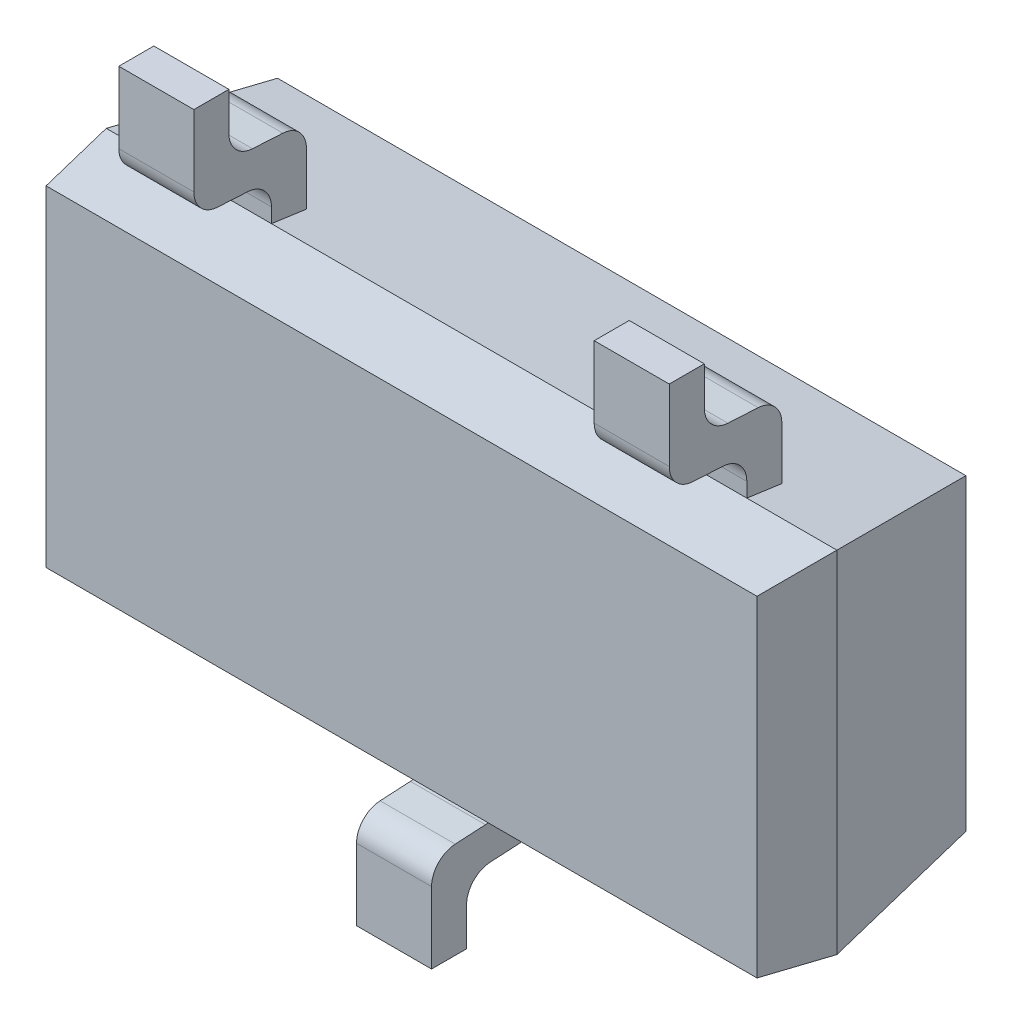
ISO-10303-21;
HEADER;
FILE_DESCRIPTION(('STEP AP214'),'2;1');
FILE_NAME('part.step','',(''),(''),'','','');
FILE_SCHEMA(('AUTOMOTIVE_DESIGN { 1 0 10303 214 1 1 1 1 }'));
ENDSEC;
DATA;
#1=APPLICATION_CONTEXT('core data for automotive mechanical design processes');
#2=APPLICATION_PROTOCOL_DEFINITION('international standard','automotive_design',2000,#1);
#3=PRODUCT_CONTEXT('',#1,'mechanical');
#4=PRODUCT('Part','Part','',(#3));
#5=PRODUCT_RELATED_PRODUCT_CATEGORY('part','',(#4));
#6=PRODUCT_DEFINITION_FORMATION('','',#4);
#7=PRODUCT_DEFINITION_CONTEXT('part definition',#1,'design');
#8=PRODUCT_DEFINITION('design','',#6,#7);
#9=PRODUCT_DEFINITION_SHAPE('','',#8);
#10=(LENGTH_UNIT() NAMED_UNIT(*) SI_UNIT(.MILLI.,.METRE.));
#11=(NAMED_UNIT(*) PLANE_ANGLE_UNIT() SI_UNIT($,.RADIAN.));
#12=(NAMED_UNIT(*) SI_UNIT($,.STERADIAN.) SOLID_ANGLE_UNIT());
#13=UNCERTAINTY_MEASURE_WITH_UNIT(LENGTH_MEASURE(1.E-05),#10,'distance_accuracy_value','');
#14=(GEOMETRIC_REPRESENTATION_CONTEXT(3) GLOBAL_UNCERTAINTY_ASSIGNED_CONTEXT((#13)) GLOBAL_UNIT_ASSIGNED_CONTEXT((#10,
#11,#12)) REPRESENTATION_CONTEXT('',''));
#15=CARTESIAN_POINT('',(0.,0.,0.));
#16=DIRECTION('',(0.,0.,1.));
#17=DIRECTION('',(1.,0.,0.));
#18=AXIS2_PLACEMENT_3D('',#15,#16,#17);
#19=CARTESIAN_POINT('',(-1.46,-0.7,0.));
#20=DIRECTION('',(0.,-0.99026806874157,-0.139173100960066));
#21=DIRECTION('',(0.,0.139173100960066,-0.99026806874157));
#22=AXIS2_PLACEMENT_3D('',#19,#20,#21);
#23=PLANE('',#22);
#24=DIRECTION('',(0.,0.139173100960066,-0.99026806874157));
#25=VECTOR('',#24,1.);
#26=CARTESIAN_POINT('',(-0.150000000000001,-0.7,0.));
#27=LINE('',#26,#25);
#28=CARTESIAN_POINT('',(-0.150000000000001,-0.7,0.));
#29=VERTEX_POINT('',#28);
#30=CARTESIAN_POINT('',(-0.150000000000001,-0.680324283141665,-0.140000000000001));
#31=VERTEX_POINT('',#30);
#32=EDGE_CURVE('E514',#29,#31,#27,.T.);
#33=ORIENTED_EDGE('',*,*,#32,.F.);
#34=DIRECTION('',(1.,0.,0.));
#35=VECTOR('',#34,1.);
#36=CARTESIAN_POINT('',(-1.46,-0.7,0.));
#37=LINE('',#36,#35);
#38=CARTESIAN_POINT('',(-1.46,-0.7,0.));
#39=VERTEX_POINT('',#38);
#40=EDGE_CURVE('E474',#39,#29,#37,.T.);
#41=ORIENTED_EDGE('',*,*,#40,.F.);
#42=DIRECTION('',(-0.137844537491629,-0.137844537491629,0.980814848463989));
#43=VECTOR('',#42,1.);
#44=CARTESIAN_POINT('',(-1.43339843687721,-0.673398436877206,-0.189279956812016));
#45=LINE('',#44,#43);
#46=CARTESIAN_POINT('',(-1.37567549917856,-0.615675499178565,-0.6));
#47=VERTEX_POINT('',#46);
#48=EDGE_CURVE('E454',#47,#39,#45,.T.);
#49=ORIENTED_EDGE('',*,*,#48,.F.);
#50=DIRECTION('',(1.,0.,0.));
#51=VECTOR('',#50,1.);
#52=CARTESIAN_POINT('',(-1.46,-0.615675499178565,-0.6));
#53=LINE('',#52,#51);
#54=CARTESIAN_POINT('',(1.37567549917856,-0.615675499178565,-0.6));
#55=VERTEX_POINT('',#54);
#56=EDGE_CURVE('E463',#47,#55,#53,.T.);
#57=ORIENTED_EDGE('',*,*,#56,.T.);
#58=DIRECTION('',(0.137844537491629,-0.137844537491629,0.980814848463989));
#59=VECTOR('',#58,1.);
#60=CARTESIAN_POINT('',(1.40451673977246,-0.644516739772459,-0.394783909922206));
#61=LINE('',#60,#59);
#62=CARTESIAN_POINT('',(1.46,-0.7,0.));
#63=VERTEX_POINT('',#62);
#64=EDGE_CURVE('E456',#55,#63,#61,.T.);
#65=ORIENTED_EDGE('',*,*,#64,.T.);
#66=CARTESIAN_POINT('',(0.150000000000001,-0.7,0.));
#67=VERTEX_POINT('',#66);
#68=EDGE_CURVE('E473',#67,#63,#37,.T.);
#69=ORIENTED_EDGE('',*,*,#68,.F.);
#70=DIRECTION('',(0.,0.139173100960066,-0.99026806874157));
#71=VECTOR('',#70,1.);
#72=CARTESIAN_POINT('',(0.150000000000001,-0.7,0.));
#73=LINE('',#72,#71);
#74=CARTESIAN_POINT('',(0.150000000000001,-0.680324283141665,-0.140000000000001));
#75=VERTEX_POINT('',#74);
#76=EDGE_CURVE('E520',#67,#75,#73,.T.);
#77=ORIENTED_EDGE('',*,*,#76,.T.);
#78=DIRECTION('',(1.,0.,0.));
#79=VECTOR('',#78,1.);
#80=CARTESIAN_POINT('',(-1.46,-0.680324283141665,-0.140000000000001));
#81=LINE('',#80,#79);
#82=EDGE_CURVE('E517',#31,#75,#81,.T.);
#83=ORIENTED_EDGE('',*,*,#82,.F.);
#84=EDGE_LOOP('',(#33,#41,#49,#57,#65,#69,#77,#83));
#85=FACE_BOUND('',#84,.T.);
#86=ADVANCED_FACE('F30',(#85),#23,.T.);
#87=CARTESIAN_POINT('',(-1.46,0.7,0.));
#88=DIRECTION('',(0.,0.99026806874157,-0.139173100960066));
#89=DIRECTION('',(0.,0.139173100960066,0.99026806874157));
#90=AXIS2_PLACEMENT_3D('',#87,#88,#89);
#91=PLANE('',#90);
#92=DIRECTION('',(-1.,0.,0.));
#93=VECTOR('',#92,1.);
#94=CARTESIAN_POINT('',(-1.46,0.7,0.));
#95=LINE('',#94,#93);
#96=CARTESIAN_POINT('',(0.8,0.7,0.));
#97=VERTEX_POINT('',#96);
#98=CARTESIAN_POINT('',(-0.799999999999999,0.7,0.));
#99=VERTEX_POINT('',#98);
#100=EDGE_CURVE('E487',#97,#99,#95,.T.);
#101=ORIENTED_EDGE('',*,*,#100,.F.);
#102=DIRECTION('',(0.,0.139173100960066,0.99026806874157));
#103=VECTOR('',#102,1.);
#104=CARTESIAN_POINT('',(0.8,0.7,0.));
#105=LINE('',#104,#103);
#106=CARTESIAN_POINT('',(0.8,0.680324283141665,-0.140000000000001));
#107=VERTEX_POINT('',#106);
#108=EDGE_CURVE('E442',#107,#97,#105,.T.);
#109=ORIENTED_EDGE('',*,*,#108,.F.);
#110=DIRECTION('',(1.,0.,0.));
#111=VECTOR('',#110,1.);
#112=CARTESIAN_POINT('',(-1.46,0.680324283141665,-0.140000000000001));
#113=LINE('',#112,#111);
#114=CARTESIAN_POINT('',(1.1,0.680324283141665,-0.140000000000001));
#115=VERTEX_POINT('',#114);
#116=EDGE_CURVE('E491',#107,#115,#113,.T.);
#117=ORIENTED_EDGE('',*,*,#116,.T.);
#118=DIRECTION('',(0.,0.139173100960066,0.99026806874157));
#119=VECTOR('',#118,1.);
#120=CARTESIAN_POINT('',(1.1,0.7,0.));
#121=LINE('',#120,#119);
#122=CARTESIAN_POINT('',(1.1,0.7,0.));
#123=VERTEX_POINT('',#122);
#124=EDGE_CURVE('E445',#115,#123,#121,.T.);
#125=ORIENTED_EDGE('',*,*,#124,.T.);
#126=CARTESIAN_POINT('',(1.46,0.7,0.));
#127=VERTEX_POINT('',#126);
#128=EDGE_CURVE('E482',#127,#123,#95,.T.);
#129=ORIENTED_EDGE('',*,*,#128,.F.);
#130=DIRECTION('',(0.137844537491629,0.137844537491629,0.980814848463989));
#131=VECTOR('',#130,1.);
#132=CARTESIAN_POINT('',(1.46,0.7,0.));
#133=LINE('',#132,#131);
#134=CARTESIAN_POINT('',(1.37567549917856,0.615675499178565,-0.6));
#135=VERTEX_POINT('',#134);
#136=EDGE_CURVE('E453',#135,#127,#133,.T.);
#137=ORIENTED_EDGE('',*,*,#136,.F.);
#138=DIRECTION('',(-1.,0.,0.));
#139=VECTOR('',#138,1.);
#140=CARTESIAN_POINT('',(-1.46,0.615675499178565,-0.6));
#141=LINE('',#140,#139);
#142=CARTESIAN_POINT('',(-1.37567549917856,0.615675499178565,-0.6));
#143=VERTEX_POINT('',#142);
#144=EDGE_CURVE('E457',#135,#143,#141,.T.);
#145=ORIENTED_EDGE('',*,*,#144,.T.);
#146=DIRECTION('',(-0.137844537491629,0.137844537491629,0.980814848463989));
#147=VECTOR('',#146,1.);
#148=CARTESIAN_POINT('',(-1.46,0.7,0.));
#149=LINE('',#148,#147);
#150=CARTESIAN_POINT('',(-1.46,0.7,0.));
#151=VERTEX_POINT('',#150);
#152=EDGE_CURVE('E449',#143,#151,#149,.T.);
#153=ORIENTED_EDGE('',*,*,#152,.T.);
#154=CARTESIAN_POINT('',(-1.1,0.7,0.));
#155=VERTEX_POINT('',#154);
#156=EDGE_CURVE('E481',#155,#151,#95,.T.);
#157=ORIENTED_EDGE('',*,*,#156,.F.);
#158=DIRECTION('',(0.,0.139173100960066,0.99026806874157));
#159=VECTOR('',#158,1.);
#160=CARTESIAN_POINT('',(-1.1,0.7,0.));
#161=LINE('',#160,#159);
#162=CARTESIAN_POINT('',(-1.1,0.680324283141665,-0.140000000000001));
#163=VERTEX_POINT('',#162);
#164=EDGE_CURVE('E394',#163,#155,#161,.T.);
#165=ORIENTED_EDGE('',*,*,#164,.F.);
#166=DIRECTION('',(1.,0.,0.));
#167=VECTOR('',#166,1.);
#168=CARTESIAN_POINT('',(-1.46,0.680324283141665,-0.140000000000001));
#169=LINE('',#168,#167);
#170=CARTESIAN_POINT('',(-0.799999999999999,0.680324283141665,-0.140000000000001));
#171=VERTEX_POINT('',#170);
#172=EDGE_CURVE('E511',#163,#171,#169,.T.);
#173=ORIENTED_EDGE('',*,*,#172,.T.);
#174=DIRECTION('',(0.,0.139173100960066,0.99026806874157));
#175=VECTOR('',#174,1.);
#176=CARTESIAN_POINT('',(-0.799999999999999,0.7,0.));
#177=LINE('',#176,#175);
#178=EDGE_CURVE('E397',#171,#99,#177,.T.);
#179=ORIENTED_EDGE('',*,*,#178,.T.);
#180=EDGE_LOOP('',(#101,#109,#117,#125,#129,#137,#145,#153,#157,#165,#173,#179));
#181=FACE_BOUND('',#180,.T.);
#182=ADVANCED_FACE('F655',(#181),#91,.T.);
#183=CARTESIAN_POINT('',(-1.46,0.7,0.));
#184=DIRECTION('',(-0.99026806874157,0.,0.139173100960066));
#185=DIRECTION('',(0.139173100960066,0.,0.99026806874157));
#186=AXIS2_PLACEMENT_3D('',#183,#184,#185);
#187=PLANE('',#186);
#188=DIRECTION('',(0.,-1.,0.));
#189=VECTOR('',#188,1.);
#190=CARTESIAN_POINT('',(-1.46,0.7,0.));
#191=LINE('',#190,#189);
#192=EDGE_CURVE('E452',#151,#39,#191,.T.);
#193=ORIENTED_EDGE('',*,*,#192,.T.);
#194=DIRECTION('',(-0.137844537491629,-0.137844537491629,-0.980814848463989));
#195=VECTOR('',#194,1.);
#196=CARTESIAN_POINT('',(-1.46,-0.7,0.));
#197=LINE('',#196,#195);
#198=CARTESIAN_POINT('',(-1.42064856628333,-0.66064856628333,0.279999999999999));
#199=VERTEX_POINT('',#198);
#200=EDGE_CURVE('E488',#199,#39,#197,.T.);
#201=ORIENTED_EDGE('',*,*,#200,.F.);
#202=DIRECTION('',(0.,1.,0.));
#203=VECTOR('',#202,1.);
#204=CARTESIAN_POINT('',(-1.42064856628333,0.7,0.279999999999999));
#205=LINE('',#204,#203);
#206=CARTESIAN_POINT('',(-1.42064856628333,0.66064856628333,0.279999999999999));
#207=VERTEX_POINT('',#206);
#208=EDGE_CURVE('E485',#207,#199,#205,.F.);
#209=ORIENTED_EDGE('',*,*,#208,.F.);
#210=DIRECTION('',(-0.137844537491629,0.137844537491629,-0.980814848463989));
#211=VECTOR('',#210,1.);
#212=CARTESIAN_POINT('',(-1.46,0.7,0.));
#213=LINE('',#212,#211);
#214=EDGE_CURVE('E493',#207,#151,#213,.T.);
#215=ORIENTED_EDGE('',*,*,#214,.T.);
#216=EDGE_LOOP('',(#193,#201,#209,#215));
#217=FACE_BOUND('',#216,.T.);
#218=ADVANCED_FACE('F663',(#217),#187,.T.);
#219=CARTESIAN_POINT('',(-1.46,-0.7,0.));
#220=DIRECTION('',(0.,-0.99026806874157,0.139173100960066));
#221=DIRECTION('',(0.,-0.139173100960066,-0.99026806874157));
#222=AXIS2_PLACEMENT_3D('',#219,#220,#221);
#223=PLANE('',#222);
#224=ORIENTED_EDGE('',*,*,#40,.T.);
#225=EDGE_CURVE('E478',#29,#67,#37,.T.);
#226=ORIENTED_EDGE('',*,*,#225,.T.);
#227=ORIENTED_EDGE('',*,*,#68,.T.);
#228=DIRECTION('',(0.137844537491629,-0.137844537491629,-0.980814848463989));
#229=VECTOR('',#228,1.);
#230=CARTESIAN_POINT('',(1.43339843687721,-0.673398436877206,0.189279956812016));
#231=LINE('',#230,#229);
#232=CARTESIAN_POINT('',(1.42064856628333,-0.66064856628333,0.279999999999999));
#233=VERTEX_POINT('',#232);
#234=EDGE_CURVE('E492',#233,#63,#231,.T.);
#235=ORIENTED_EDGE('',*,*,#234,.F.);
#236=DIRECTION('',(-1.,0.,0.));
#237=VECTOR('',#236,1.);
#238=CARTESIAN_POINT('',(-1.46,-0.66064856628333,0.279999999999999));
#239=LINE('',#238,#237);
#240=EDGE_CURVE('E504',#199,#233,#239,.F.);
#241=ORIENTED_EDGE('',*,*,#240,.F.);
#242=ORIENTED_EDGE('',*,*,#200,.T.);
#243=EDGE_LOOP('',(#224,#226,#227,#235,#241,#242));
#244=FACE_BOUND('',#243,.T.);
#245=ADVANCED_FACE('F32',(#244),#223,.T.);
#246=CARTESIAN_POINT('',(1.46,0.7,0.));
#247=DIRECTION('',(0.99026806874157,0.,0.139173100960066));
#248=DIRECTION('',(0.139173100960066,0.,-0.99026806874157));
#249=AXIS2_PLACEMENT_3D('',#246,#247,#248);
#250=PLANE('',#249);
#251=DIRECTION('',(0.,1.,0.));
#252=VECTOR('',#251,1.);
#253=CARTESIAN_POINT('',(1.46,0.7,0.));
#254=LINE('',#253,#252);
#255=EDGE_CURVE('E477',#63,#127,#254,.T.);
#256=ORIENTED_EDGE('',*,*,#255,.T.);
#257=DIRECTION('',(0.137844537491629,0.137844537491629,-0.980814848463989));
#258=VECTOR('',#257,1.);
#259=CARTESIAN_POINT('',(1.40451673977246,0.644516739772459,0.394783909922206));
#260=LINE('',#259,#258);
#261=CARTESIAN_POINT('',(1.42064856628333,0.66064856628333,0.279999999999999));
#262=VERTEX_POINT('',#261);
#263=EDGE_CURVE('E496',#262,#127,#260,.T.);
#264=ORIENTED_EDGE('',*,*,#263,.F.);
#265=DIRECTION('',(0.,-1.,0.));
#266=VECTOR('',#265,1.);
#267=CARTESIAN_POINT('',(1.42064856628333,0.7,0.279999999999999));
#268=LINE('',#267,#266);
#269=EDGE_CURVE('E506',#233,#262,#268,.F.);
#270=ORIENTED_EDGE('',*,*,#269,.F.);
#271=ORIENTED_EDGE('',*,*,#234,.T.);
#272=EDGE_LOOP('',(#256,#264,#270,#271));
#273=FACE_BOUND('',#272,.T.);
#274=ADVANCED_FACE('F671',(#273),#250,.T.);
#275=CARTESIAN_POINT('',(-1.46,0.7,0.));
#276=DIRECTION('',(0.,0.99026806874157,0.139173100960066));
#277=DIRECTION('',(0.,-0.139173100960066,0.99026806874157));
#278=AXIS2_PLACEMENT_3D('',#275,#276,#277);
#279=PLANE('',#278);
#280=ORIENTED_EDGE('',*,*,#128,.T.);
#281=EDGE_CURVE('E486',#123,#97,#95,.T.);
#282=ORIENTED_EDGE('',*,*,#281,.T.);
#283=ORIENTED_EDGE('',*,*,#100,.T.);
#284=EDGE_CURVE('E638',#99,#155,#95,.T.);
#285=ORIENTED_EDGE('',*,*,#284,.T.);
#286=ORIENTED_EDGE('',*,*,#156,.T.);
#287=ORIENTED_EDGE('',*,*,#214,.F.);
#288=DIRECTION('',(1.,0.,0.));
#289=VECTOR('',#288,1.);
#290=CARTESIAN_POINT('',(-1.46,0.66064856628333,0.279999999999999));
#291=LINE('',#290,#289);
#292=EDGE_CURVE('E497',#262,#207,#291,.F.);
#293=ORIENTED_EDGE('',*,*,#292,.F.);
#294=ORIENTED_EDGE('',*,*,#263,.T.);
#295=EDGE_LOOP('',(#280,#282,#283,#285,#286,#287,#293,#294));
#296=FACE_BOUND('',#295,.T.);
#297=ADVANCED_FACE('F645',(#296),#279,.T.);
#298=CARTESIAN_POINT('',(-1.46,-0.7,0.279999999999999));
#299=DIRECTION('',(0.,0.,1.));
#300=DIRECTION('',(1.,0.,0.));
#301=AXIS2_PLACEMENT_3D('',#298,#299,#300);
#302=PLANE('',#301);
#303=ORIENTED_EDGE('',*,*,#208,.T.);
#304=ORIENTED_EDGE('',*,*,#240,.T.);
#305=ORIENTED_EDGE('',*,*,#269,.T.);
#306=ORIENTED_EDGE('',*,*,#292,.T.);
#307=EDGE_LOOP('',(#303,#304,#305,#306));
#308=FACE_BOUND('',#307,.T.);
#309=ADVANCED_FACE('F665',(#308),#302,.T.);
#310=CARTESIAN_POINT('',(-1.46,0.7,0.));
#311=DIRECTION('',(-0.99026806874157,0.,-0.139173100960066));
#312=DIRECTION('',(-0.139173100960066,0.,0.99026806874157));
#313=AXIS2_PLACEMENT_3D('',#310,#311,#312);
#314=PLANE('',#313);
#315=ORIENTED_EDGE('',*,*,#192,.F.);
#316=ORIENTED_EDGE('',*,*,#152,.F.);
#317=DIRECTION('',(0.,-1.,0.));
#318=VECTOR('',#317,1.);
#319=CARTESIAN_POINT('',(-1.37567549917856,-0.7,-0.6));
#320=LINE('',#319,#318);
#321=EDGE_CURVE('E448',#143,#47,#320,.T.);
#322=ORIENTED_EDGE('',*,*,#321,.T.);
#323=ORIENTED_EDGE('',*,*,#48,.T.);
#324=EDGE_LOOP('',(#315,#316,#322,#323));
#325=FACE_BOUND('',#324,.T.);
#326=ADVANCED_FACE('F659',(#325),#314,.T.);
#327=CARTESIAN_POINT('',(1.46,0.7,0.));
#328=DIRECTION('',(0.99026806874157,0.,-0.139173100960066));
#329=DIRECTION('',(-0.139173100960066,0.,-0.99026806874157));
#330=AXIS2_PLACEMENT_3D('',#327,#328,#329);
#331=PLANE('',#330);
#332=ORIENTED_EDGE('',*,*,#255,.F.);
#333=ORIENTED_EDGE('',*,*,#64,.F.);
#334=DIRECTION('',(0.,1.,0.));
#335=VECTOR('',#334,1.);
#336=CARTESIAN_POINT('',(1.37567549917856,-0.7,-0.6));
#337=LINE('',#336,#335);
#338=EDGE_CURVE('E466',#55,#135,#337,.T.);
#339=ORIENTED_EDGE('',*,*,#338,.T.);
#340=ORIENTED_EDGE('',*,*,#136,.T.);
#341=EDGE_LOOP('',(#332,#333,#339,#340));
#342=FACE_BOUND('',#341,.T.);
#343=ADVANCED_FACE('F674',(#342),#331,.T.);
#344=CARTESIAN_POINT('',(-1.46,-0.7,-0.6));
#345=DIRECTION('',(0.,0.,1.));
#346=DIRECTION('',(1.,0.,0.));
#347=AXIS2_PLACEMENT_3D('',#344,#345,#346);
#348=PLANE('',#347);
#349=ORIENTED_EDGE('',*,*,#321,.F.);
#350=ORIENTED_EDGE('',*,*,#144,.F.);
#351=ORIENTED_EDGE('',*,*,#338,.F.);
#352=ORIENTED_EDGE('',*,*,#56,.F.);
#353=EDGE_LOOP('',(#349,#350,#351,#352));
#354=FACE_BOUND('',#353,.T.);
#355=ADVANCED_FACE('F682',(#354),#348,.F.);
#356=CARTESIAN_POINT('',(1.1,0.,0.));
#357=DIRECTION('',(0.,0.,-1.));
#358=DIRECTION('',(-1.,0.,0.));
#359=AXIS2_PLACEMENT_3D('',#356,#357,#358);
#360=PLANE('',#359);
#361=DIRECTION('',(0.,-1.,0.));
#362=VECTOR('',#361,1.);
#363=CARTESIAN_POINT('',(1.1,0.,0.));
#364=LINE('',#363,#362);
#365=CARTESIAN_POINT('',(1.1,0.758198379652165,0.));
#366=VERTEX_POINT('',#365);
#367=EDGE_CURVE('E435',#366,#123,#364,.T.);
#368=ORIENTED_EDGE('',*,*,#367,.F.);
#369=DIRECTION('',(-1.,0.,0.));
#370=VECTOR('',#369,1.);
#371=CARTESIAN_POINT('',(0.8,0.758198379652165,0.));
#372=LINE('',#371,#370);
#373=CARTESIAN_POINT('',(0.8,0.758198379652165,0.));
#374=VERTEX_POINT('',#373);
#375=EDGE_CURVE('E571',#366,#374,#372,.T.);
#376=ORIENTED_EDGE('',*,*,#375,.T.);
#377=DIRECTION('',(0.,-1.,0.));
#378=VECTOR('',#377,1.);
#379=CARTESIAN_POINT('',(0.8,0.,0.));
#380=LINE('',#379,#378);
#381=EDGE_CURVE('E417',#374,#97,#380,.T.);
#382=ORIENTED_EDGE('',*,*,#381,.T.);
#383=ORIENTED_EDGE('',*,*,#281,.F.);
#384=EDGE_LOOP('',(#368,#376,#382,#383));
#385=FACE_BOUND('',#384,.T.);
#386=ADVANCED_FACE('F684',(#385),#360,.F.);
#387=CARTESIAN_POINT('',(1.1,0.985255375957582,-0.139999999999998));
#388=DIRECTION('',(0.,0.,1.));
#389=DIRECTION('',(0.,-1.,0.));
#390=AXIS2_PLACEMENT_3D('',#387,#388,#389);
#391=PLANE('',#390);
#392=DIRECTION('',(0.,1.,0.));
#393=VECTOR('',#392,1.);
#394=CARTESIAN_POINT('',(0.8,0.985255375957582,-0.139999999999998));
#395=LINE('',#394,#393);
#396=CARTESIAN_POINT('',(0.8,0.890648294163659,-0.140000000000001));
#397=VERTEX_POINT('',#396);
#398=EDGE_CURVE('E400',#107,#397,#395,.T.);
#399=ORIENTED_EDGE('',*,*,#398,.T.);
#400=DIRECTION('',(-1.,0.,0.));
#401=VECTOR('',#400,1.);
#402=CARTESIAN_POINT('',(1.1,0.890648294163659,-0.139999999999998));
#403=LINE('',#402,#401);
#404=CARTESIAN_POINT('',(1.1,0.890648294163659,-0.139999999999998));
#405=VERTEX_POINT('',#404);
#406=EDGE_CURVE('E574',#397,#405,#403,.F.);
#407=ORIENTED_EDGE('',*,*,#406,.T.);
#408=DIRECTION('',(0.,1.,0.));
#409=VECTOR('',#408,1.);
#410=CARTESIAN_POINT('',(1.1,0.985255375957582,-0.139999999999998));
#411=LINE('',#410,#409);
#412=EDGE_CURVE('E419',#115,#405,#411,.T.);
#413=ORIENTED_EDGE('',*,*,#412,.F.);
#414=ORIENTED_EDGE('',*,*,#116,.F.);
#415=EDGE_LOOP('',(#399,#407,#413,#414));
#416=FACE_BOUND('',#415,.T.);
#417=ADVANCED_FACE('F690',(#416),#391,.F.);
#418=CARTESIAN_POINT('',(1.1,1.00244991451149,0.17));
#419=DIRECTION('',(0.,-0.998465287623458,0.0553811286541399));
#420=DIRECTION('',(0.,-0.0553811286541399,-0.998465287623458));
#421=AXIS2_PLACEMENT_3D('',#418,#419,#420);
#422=PLANE('',#421);
#423=DIRECTION('',(0.,0.0553811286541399,0.998465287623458));
#424=VECTOR('',#423,1.);
#425=CARTESIAN_POINT('',(0.8,1.00244991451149,0.17));
#426=LINE('',#425,#424);
#427=CARTESIAN_POINT('',(0.8,0.990494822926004,-0.0455381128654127));
#428=VERTEX_POINT('',#427);
#429=CARTESIAN_POINT('',(0.8,0.997210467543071,0.0755381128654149));
#430=VERTEX_POINT('',#429);
#431=EDGE_CURVE('E403',#428,#430,#426,.T.);
#432=ORIENTED_EDGE('',*,*,#431,.T.);
#433=DIRECTION('',(-1.,0.,0.));
#434=VECTOR('',#433,1.);
#435=CARTESIAN_POINT('',(1.1,0.997210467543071,0.0755381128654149));
#436=LINE('',#435,#434);
#437=CARTESIAN_POINT('',(1.1,0.997210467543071,0.0755381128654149));
#438=VERTEX_POINT('',#437);
#439=EDGE_CURVE('E569',#430,#438,#436,.F.);
#440=ORIENTED_EDGE('',*,*,#439,.T.);
#441=DIRECTION('',(0.,0.0553811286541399,0.998465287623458));
#442=VECTOR('',#441,1.);
#443=CARTESIAN_POINT('',(1.1,1.00244991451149,0.17));
#444=LINE('',#443,#442);
#445=CARTESIAN_POINT('',(1.1,0.990494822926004,-0.0455381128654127));
#446=VERTEX_POINT('',#445);
#447=EDGE_CURVE('E422',#446,#438,#444,.T.);
#448=ORIENTED_EDGE('',*,*,#447,.F.);
#449=DIRECTION('',(-1.,0.,0.));
#450=VECTOR('',#449,1.);
#451=CARTESIAN_POINT('',(1.1,0.990494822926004,-0.0455381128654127));
#452=LINE('',#451,#450);
#453=EDGE_CURVE('E566',#446,#428,#452,.T.);
#454=ORIENTED_EDGE('',*,*,#453,.T.);
#455=EDGE_LOOP('',(#432,#440,#448,#454));
#456=FACE_BOUND('',#455,.T.);
#457=ADVANCED_FACE('F828',(#456),#422,.F.);
#458=CARTESIAN_POINT('',(1.1,1.25,0.17));
#459=DIRECTION('',(0.,0.,1.));
#460=DIRECTION('',(0.,-1.,0.));
#461=AXIS2_PLACEMENT_3D('',#458,#459,#460);
#462=PLANE('',#461);
#463=DIRECTION('',(0.,1.,0.));
#464=VECTOR('',#463,1.);
#465=CARTESIAN_POINT('',(1.1,1.25,0.17));
#466=LINE('',#465,#464);
#467=CARTESIAN_POINT('',(1.1,1.09705699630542,0.17));
#468=VERTEX_POINT('',#467);
#469=CARTESIAN_POINT('',(1.1,1.25,0.17));
#470=VERTEX_POINT('',#469);
#471=EDGE_CURVE('E425',#468,#470,#466,.T.);
#472=ORIENTED_EDGE('',*,*,#471,.F.);
#473=DIRECTION('',(-1.,0.,0.));
#474=VECTOR('',#473,1.);
#475=CARTESIAN_POINT('',(0.8,1.09705699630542,0.17));
#476=LINE('',#475,#474);
#477=CARTESIAN_POINT('',(0.8,1.09705699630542,0.17));
#478=VERTEX_POINT('',#477);
#479=EDGE_CURVE('E563',#468,#478,#476,.T.);
#480=ORIENTED_EDGE('',*,*,#479,.T.);
#481=DIRECTION('',(0.,1.,0.));
#482=VECTOR('',#481,1.);
#483=CARTESIAN_POINT('',(0.8,1.25,0.17));
#484=LINE('',#483,#482);
#485=CARTESIAN_POINT('',(0.8,1.25,0.17));
#486=VERTEX_POINT('',#485);
#487=EDGE_CURVE('E406',#478,#486,#484,.T.);
#488=ORIENTED_EDGE('',*,*,#487,.T.);
#489=DIRECTION('',(-1.,0.,0.));
#490=VECTOR('',#489,1.);
#491=CARTESIAN_POINT('',(1.1,1.25,0.17));
#492=LINE('',#491,#490);
#493=EDGE_CURVE('E439',#470,#486,#492,.T.);
#494=ORIENTED_EDGE('',*,*,#493,.F.);
#495=EDGE_LOOP('',(#472,#480,#488,#494));
#496=FACE_BOUND('',#495,.T.);
#497=ADVANCED_FACE('F824',(#496),#462,.F.);
#498=CARTESIAN_POINT('',(1.1,1.25,0.310000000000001));
#499=DIRECTION('',(0.,-1.,0.));
#500=DIRECTION('',(0.,0.,-1.));
#501=AXIS2_PLACEMENT_3D('',#498,#499,#500);
#502=PLANE('',#501);
#503=ORIENTED_EDGE('',*,*,#493,.T.);
#504=DIRECTION('',(0.,0.,1.));
#505=VECTOR('',#504,1.);
#506=CARTESIAN_POINT('',(0.8,1.25,0.310000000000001));
#507=LINE('',#506,#505);
#508=CARTESIAN_POINT('',(0.8,1.25,0.310000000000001));
#509=VERTEX_POINT('',#508);
#510=EDGE_CURVE('E408',#486,#509,#507,.T.);
#511=ORIENTED_EDGE('',*,*,#510,.T.);
#512=DIRECTION('',(-1.,0.,0.));
#513=VECTOR('',#512,1.);
#514=CARTESIAN_POINT('',(1.1,1.25,0.310000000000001));
#515=LINE('',#514,#513);
#516=CARTESIAN_POINT('',(1.1,1.25,0.310000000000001));
#517=VERTEX_POINT('',#516);
#518=EDGE_CURVE('E437',#517,#509,#515,.T.);
#519=ORIENTED_EDGE('',*,*,#518,.F.);
#520=DIRECTION('',(0.,0.,1.));
#521=VECTOR('',#520,1.);
#522=CARTESIAN_POINT('',(1.1,1.25,0.310000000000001));
#523=LINE('',#522,#521);
#524=EDGE_CURVE('E427',#470,#517,#523,.T.);
#525=ORIENTED_EDGE('',*,*,#524,.F.);
#526=EDGE_LOOP('',(#503,#511,#519,#525));
#527=FACE_BOUND('',#526,.T.);
#528=ADVANCED_FACE('F820',(#527),#502,.F.);
#529=CARTESIAN_POINT('',(1.1,0.87,0.310000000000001));
#530=DIRECTION('',(0.,0.,-1.));
#531=DIRECTION('',(-1.,0.,0.));
#532=AXIS2_PLACEMENT_3D('',#529,#530,#531);
#533=PLANE('',#532);
#534=DIRECTION('',(0.,-1.,0.));
#535=VECTOR('',#534,1.);
#536=CARTESIAN_POINT('',(0.8,0.87,0.310000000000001));
#537=LINE('',#536,#535);
#538=CARTESIAN_POINT('',(0.8,0.964607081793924,0.310000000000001));
#539=VERTEX_POINT('',#538);
#540=EDGE_CURVE('E411',#509,#539,#537,.T.);
#541=ORIENTED_EDGE('',*,*,#540,.T.);
#542=DIRECTION('',(-1.,0.,0.));
#543=VECTOR('',#542,1.);
#544=CARTESIAN_POINT('',(1.1,0.964607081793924,0.310000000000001));
#545=LINE('',#544,#543);
#546=CARTESIAN_POINT('',(1.1,0.964607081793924,0.310000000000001));
#547=VERTEX_POINT('',#546);
#548=EDGE_CURVE('E557',#539,#547,#545,.F.);
#549=ORIENTED_EDGE('',*,*,#548,.T.);
#550=DIRECTION('',(0.,-1.,0.));
#551=VECTOR('',#550,1.);
#552=CARTESIAN_POINT('',(1.1,0.87,0.310000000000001));
#553=LINE('',#552,#551);
#554=EDGE_CURVE('E429',#517,#547,#553,.T.);
#555=ORIENTED_EDGE('',*,*,#554,.F.);
#556=ORIENTED_EDGE('',*,*,#518,.T.);
#557=EDGE_LOOP('',(#541,#549,#555,#556));
#558=FACE_BOUND('',#557,.T.);
#559=ADVANCED_FACE('F816',(#558),#533,.F.);
#560=CARTESIAN_POINT('',(1.1,0.852805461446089,0.));
#561=DIRECTION('',(0.,0.998465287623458,-0.0553811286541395));
#562=DIRECTION('',(0.,0.0553811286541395,0.998465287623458));
#563=AXIS2_PLACEMENT_3D('',#560,#561,#562);
#564=PLANE('',#563);
#565=DIRECTION('',(0.,-0.0553811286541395,-0.998465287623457));
#566=VECTOR('',#565,1.);
#567=CARTESIAN_POINT('',(1.1,0.852805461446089,0.));
#568=LINE('',#567,#566);
#569=CARTESIAN_POINT('',(1.1,0.864760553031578,0.215538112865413));
#570=VERTEX_POINT('',#569);
#571=CARTESIAN_POINT('',(1.1,0.858044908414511,0.0944618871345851));
#572=VERTEX_POINT('',#571);
#573=EDGE_CURVE('E432',#570,#572,#568,.T.);
#574=ORIENTED_EDGE('',*,*,#573,.F.);
#575=DIRECTION('',(-1.,0.,0.));
#576=VECTOR('',#575,1.);
#577=CARTESIAN_POINT('',(1.1,0.864760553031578,0.215538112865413));
#578=LINE('',#577,#576);
#579=CARTESIAN_POINT('',(0.8,0.864760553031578,0.215538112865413));
#580=VERTEX_POINT('',#579);
#581=EDGE_CURVE('E550',#570,#580,#578,.T.);
#582=ORIENTED_EDGE('',*,*,#581,.T.);
#583=DIRECTION('',(0.,-0.0553811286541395,-0.998465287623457));
#584=VECTOR('',#583,1.);
#585=CARTESIAN_POINT('',(0.8,0.852805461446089,0.));
#586=LINE('',#585,#584);
#587=CARTESIAN_POINT('',(0.8,0.858044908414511,0.0944618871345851));
#588=VERTEX_POINT('',#587);
#589=EDGE_CURVE('E414',#580,#588,#586,.T.);
#590=ORIENTED_EDGE('',*,*,#589,.T.);
#591=DIRECTION('',(-1.,0.,0.));
#592=VECTOR('',#591,1.);
#593=CARTESIAN_POINT('',(1.1,0.858044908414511,0.0944618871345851));
#594=LINE('',#593,#592);
#595=EDGE_CURVE('E548',#588,#572,#594,.F.);
#596=ORIENTED_EDGE('',*,*,#595,.T.);
#597=EDGE_LOOP('',(#574,#582,#590,#596));
#598=FACE_BOUND('',#597,.T.);
#599=ADVANCED_FACE('F811',(#598),#564,.F.);
#600=CARTESIAN_POINT('',(1.1,0.,0.));
#601=DIRECTION('',(-1.,0.,0.));
#602=DIRECTION('',(0.,0.,1.));
#603=AXIS2_PLACEMENT_3D('',#600,#601,#602);
#604=PLANE('',#603);
#605=ORIENTED_EDGE('',*,*,#554,.T.);
#606=CARTESIAN_POINT('',(1.1,0.964607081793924,0.210000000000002));
#607=DIRECTION('',(-1.,0.,0.));
#608=DIRECTION('',(0.,0.,1.));
#609=AXIS2_PLACEMENT_3D('',#606,#607,#608);
#610=CIRCLE('',#609,0.1);
#611=EDGE_CURVE('E561',#547,#570,#610,.F.);
#612=ORIENTED_EDGE('',*,*,#611,.T.);
#613=ORIENTED_EDGE('',*,*,#573,.T.);
#614=CARTESIAN_POINT('',(1.1,0.758198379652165,0.0999999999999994));
#615=DIRECTION('',(-1.,0.,0.));
#616=DIRECTION('',(0.,0.,1.));
#617=AXIS2_PLACEMENT_3D('',#614,#615,#616);
#618=CIRCLE('',#617,0.1);
#619=EDGE_CURVE('E618',#572,#366,#618,.T.);
#620=ORIENTED_EDGE('',*,*,#619,.T.);
#621=ORIENTED_EDGE('',*,*,#367,.T.);
#622=ORIENTED_EDGE('',*,*,#124,.F.);
#623=ORIENTED_EDGE('',*,*,#412,.T.);
#624=CARTESIAN_POINT('',(1.1,0.890648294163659,-0.0399999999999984));
#625=DIRECTION('',(-1.,0.,0.));
#626=DIRECTION('',(0.,0.,1.));
#627=AXIS2_PLACEMENT_3D('',#624,#625,#626);
#628=CIRCLE('',#627,0.1);
#629=EDGE_CURVE('E559',#405,#446,#628,.F.);
#630=ORIENTED_EDGE('',*,*,#629,.T.);
#631=ORIENTED_EDGE('',*,*,#447,.T.);
#632=CARTESIAN_POINT('',(1.1,1.09705699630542,0.0700000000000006));
#633=DIRECTION('',(-1.,0.,0.));
#634=DIRECTION('',(0.,0.,1.));
#635=AXIS2_PLACEMENT_3D('',#632,#633,#634);
#636=CIRCLE('',#635,0.1);
#637=EDGE_CURVE('E614',#438,#468,#636,.T.);
#638=ORIENTED_EDGE('',*,*,#637,.T.);
#639=ORIENTED_EDGE('',*,*,#471,.T.);
#640=ORIENTED_EDGE('',*,*,#524,.T.);
#641=EDGE_LOOP('',(#605,#612,#613,#620,#621,#622,#623,#630,#631,#638,#639,#640));
#642=FACE_BOUND('',#641,.T.);
#643=ADVANCED_FACE('F808',(#642),#604,.F.);
#644=CARTESIAN_POINT('',(0.8,0.,0.));
#645=DIRECTION('',(-1.,0.,0.));
#646=DIRECTION('',(0.,0.,1.));
#647=AXIS2_PLACEMENT_3D('',#644,#645,#646);
#648=PLANE('',#647);
#649=ORIENTED_EDGE('',*,*,#589,.F.);
#650=CARTESIAN_POINT('',(0.8,0.964607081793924,0.210000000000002));
#651=DIRECTION('',(-1.,0.,0.));
#652=DIRECTION('',(0.,0.,1.));
#653=AXIS2_PLACEMENT_3D('',#650,#651,#652);
#654=CIRCLE('',#653,0.1);
#655=EDGE_CURVE('E555',#580,#539,#654,.T.);
#656=ORIENTED_EDGE('',*,*,#655,.T.);
#657=ORIENTED_EDGE('',*,*,#540,.F.);
#658=ORIENTED_EDGE('',*,*,#510,.F.);
#659=ORIENTED_EDGE('',*,*,#487,.F.);
#660=CARTESIAN_POINT('',(0.8,1.09705699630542,0.0700000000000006));
#661=DIRECTION('',(-1.,0.,0.));
#662=DIRECTION('',(0.,0.,1.));
#663=AXIS2_PLACEMENT_3D('',#660,#661,#662);
#664=CIRCLE('',#663,0.1);
#665=EDGE_CURVE('E612',#478,#430,#664,.F.);
#666=ORIENTED_EDGE('',*,*,#665,.T.);
#667=ORIENTED_EDGE('',*,*,#431,.F.);
#668=CARTESIAN_POINT('',(0.8,0.890648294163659,-0.0399999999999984));
#669=DIRECTION('',(-1.,0.,0.));
#670=DIRECTION('',(0.,0.,1.));
#671=AXIS2_PLACEMENT_3D('',#668,#669,#670);
#672=CIRCLE('',#671,0.1);
#673=EDGE_CURVE('E553',#428,#397,#672,.T.);
#674=ORIENTED_EDGE('',*,*,#673,.T.);
#675=ORIENTED_EDGE('',*,*,#398,.F.);
#676=ORIENTED_EDGE('',*,*,#108,.T.);
#677=ORIENTED_EDGE('',*,*,#381,.F.);
#678=CARTESIAN_POINT('',(0.8,0.758198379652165,0.0999999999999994));
#679=DIRECTION('',(-1.,0.,0.));
#680=DIRECTION('',(0.,0.,1.));
#681=AXIS2_PLACEMENT_3D('',#678,#679,#680);
#682=CIRCLE('',#681,0.1);
#683=EDGE_CURVE('E616',#374,#588,#682,.F.);
#684=ORIENTED_EDGE('',*,*,#683,.T.);
#685=EDGE_LOOP('',(#649,#656,#657,#658,#659,#666,#667,#674,#675,#676,#677,#684));
#686=FACE_BOUND('',#685,.T.);
#687=ADVANCED_FACE('F784',(#686),#648,.T.);
#688=CARTESIAN_POINT('',(-0.799999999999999,0.,0.));
#689=DIRECTION('',(0.,0.,-1.));
#690=DIRECTION('',(-1.,0.,0.));
#691=AXIS2_PLACEMENT_3D('',#688,#689,#690);
#692=PLANE('',#691);
#693=DIRECTION('',(0.,-1.,0.));
#694=VECTOR('',#693,1.);
#695=CARTESIAN_POINT('',(-0.799999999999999,0.,0.));
#696=LINE('',#695,#694);
#697=CARTESIAN_POINT('',(-0.799999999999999,0.758198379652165,0.));
#698=VERTEX_POINT('',#697);
#699=EDGE_CURVE('E387',#698,#99,#696,.T.);
#700=ORIENTED_EDGE('',*,*,#699,.F.);
#701=DIRECTION('',(-1.,0.,0.));
#702=VECTOR('',#701,1.);
#703=CARTESIAN_POINT('',(-1.1,0.758198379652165,0.));
#704=LINE('',#703,#702);
#705=CARTESIAN_POINT('',(-1.1,0.758198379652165,0.));
#706=VERTEX_POINT('',#705);
#707=EDGE_CURVE('E599',#698,#706,#704,.T.);
#708=ORIENTED_EDGE('',*,*,#707,.T.);
#709=DIRECTION('',(0.,-1.,0.));
#710=VECTOR('',#709,1.);
#711=CARTESIAN_POINT('',(-1.1,0.,0.));
#712=LINE('',#711,#710);
#713=EDGE_CURVE('E371',#706,#155,#712,.T.);
#714=ORIENTED_EDGE('',*,*,#713,.T.);
#715=ORIENTED_EDGE('',*,*,#284,.F.);
#716=EDGE_LOOP('',(#700,#708,#714,#715));
#717=FACE_BOUND('',#716,.T.);
#718=ADVANCED_FACE('F635',(#717),#692,.F.);
#719=CARTESIAN_POINT('',(-0.799999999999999,0.985255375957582,-0.140000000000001));
#720=DIRECTION('',(0.,0.,1.));
#721=DIRECTION('',(0.,-1.,0.));
#722=AXIS2_PLACEMENT_3D('',#719,#720,#721);
#723=PLANE('',#722);
#724=DIRECTION('',(0.,1.,0.));
#725=VECTOR('',#724,1.);
#726=CARTESIAN_POINT('',(-1.1,0.985255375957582,-0.140000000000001));
#727=LINE('',#726,#725);
#728=CARTESIAN_POINT('',(-1.1,0.890648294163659,-0.140000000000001));
#729=VERTEX_POINT('',#728);
#730=EDGE_CURVE('E309',#163,#729,#727,.T.);
#731=ORIENTED_EDGE('',*,*,#730,.T.);
#732=DIRECTION('',(-1.,0.,0.));
#733=VECTOR('',#732,1.);
#734=CARTESIAN_POINT('',(-0.799999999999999,0.890648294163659,-0.140000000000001));
#735=LINE('',#734,#733);
#736=CARTESIAN_POINT('',(-0.799999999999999,0.890648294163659,-0.140000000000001));
#737=VERTEX_POINT('',#736);
#738=EDGE_CURVE('E602',#729,#737,#735,.F.);
#739=ORIENTED_EDGE('',*,*,#738,.T.);
#740=DIRECTION('',(0.,1.,0.));
#741=VECTOR('',#740,1.);
#742=CARTESIAN_POINT('',(-0.799999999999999,0.985255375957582,-0.140000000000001));
#743=LINE('',#742,#741);
#744=EDGE_CURVE('E373',#171,#737,#743,.T.);
#745=ORIENTED_EDGE('',*,*,#744,.F.);
#746=ORIENTED_EDGE('',*,*,#172,.F.);
#747=EDGE_LOOP('',(#731,#739,#745,#746));
#748=FACE_BOUND('',#747,.T.);
#749=ADVANCED_FACE('F783',(#748),#723,.F.);
#750=CARTESIAN_POINT('',(-0.799999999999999,1.00244991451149,0.17));
#751=DIRECTION('',(0.,-0.998465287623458,0.0553811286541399));
#752=DIRECTION('',(0.,-0.0553811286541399,-0.998465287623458));
#753=AXIS2_PLACEMENT_3D('',#750,#751,#752);
#754=PLANE('',#753);
#755=DIRECTION('',(0.,0.0553811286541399,0.998465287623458));
#756=VECTOR('',#755,1.);
#757=CARTESIAN_POINT('',(-1.1,1.00244991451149,0.17));
#758=LINE('',#757,#756);
#759=CARTESIAN_POINT('',(-1.1,0.990494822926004,-0.0455381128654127));
#760=VERTEX_POINT('',#759);
#761=CARTESIAN_POINT('',(-1.1,0.997210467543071,0.0755381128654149));
#762=VERTEX_POINT('',#761);
#763=EDGE_CURVE('E357',#760,#762,#758,.T.);
#764=ORIENTED_EDGE('',*,*,#763,.T.);
#765=DIRECTION('',(-1.,0.,0.));
#766=VECTOR('',#765,1.);
#767=CARTESIAN_POINT('',(-0.799999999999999,0.997210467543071,0.0755381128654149));
#768=LINE('',#767,#766);
#769=CARTESIAN_POINT('',(-0.799999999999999,0.997210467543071,0.0755381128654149));
#770=VERTEX_POINT('',#769);
#771=EDGE_CURVE('E597',#762,#770,#768,.F.);
#772=ORIENTED_EDGE('',*,*,#771,.T.);
#773=DIRECTION('',(0.,0.0553811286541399,0.998465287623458));
#774=VECTOR('',#773,1.);
#775=CARTESIAN_POINT('',(-0.799999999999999,1.00244991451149,0.17));
#776=LINE('',#775,#774);
#777=CARTESIAN_POINT('',(-0.799999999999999,0.990494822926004,-0.0455381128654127));
#778=VERTEX_POINT('',#777);
#779=EDGE_CURVE('E376',#778,#770,#776,.T.);
#780=ORIENTED_EDGE('',*,*,#779,.F.);
#781=DIRECTION('',(-1.,0.,0.));
#782=VECTOR('',#781,1.);
#783=CARTESIAN_POINT('',(-0.799999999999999,0.990494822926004,-0.0455381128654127));
#784=LINE('',#783,#782);
#785=EDGE_CURVE('E594',#778,#760,#784,.T.);
#786=ORIENTED_EDGE('',*,*,#785,.T.);
#787=EDGE_LOOP('',(#764,#772,#780,#786));
#788=FACE_BOUND('',#787,.T.);
#789=ADVANCED_FACE('F798',(#788),#754,.F.);
#790=CARTESIAN_POINT('',(-0.799999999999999,1.25,0.17));
#791=DIRECTION('',(0.,0.,1.));
#792=DIRECTION('',(0.,-1.,0.));
#793=AXIS2_PLACEMENT_3D('',#790,#791,#792);
#794=PLANE('',#793);
#795=DIRECTION('',(0.,1.,0.));
#796=VECTOR('',#795,1.);
#797=CARTESIAN_POINT('',(-0.799999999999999,1.25,0.17));
#798=LINE('',#797,#796);
#799=CARTESIAN_POINT('',(-0.799999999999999,1.09705699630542,0.17));
#800=VERTEX_POINT('',#799);
#801=CARTESIAN_POINT('',(-0.799999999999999,1.25,0.17));
#802=VERTEX_POINT('',#801);
#803=EDGE_CURVE('E378',#800,#802,#798,.T.);
#804=ORIENTED_EDGE('',*,*,#803,.F.);
#805=DIRECTION('',(-1.,0.,0.));
#806=VECTOR('',#805,1.);
#807=CARTESIAN_POINT('',(-1.1,1.09705699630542,0.17));
#808=LINE('',#807,#806);
#809=CARTESIAN_POINT('',(-1.1,1.09705699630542,0.17));
#810=VERTEX_POINT('',#809);
#811=EDGE_CURVE('E591',#800,#810,#808,.T.);
#812=ORIENTED_EDGE('',*,*,#811,.T.);
#813=DIRECTION('',(0.,1.,0.));
#814=VECTOR('',#813,1.);
#815=CARTESIAN_POINT('',(-1.1,1.25,0.17));
#816=LINE('',#815,#814);
#817=CARTESIAN_POINT('',(-1.1,1.25,0.17));
#818=VERTEX_POINT('',#817);
#819=EDGE_CURVE('E360',#810,#818,#816,.T.);
#820=ORIENTED_EDGE('',*,*,#819,.T.);
#821=DIRECTION('',(-1.,0.,0.));
#822=VECTOR('',#821,1.);
#823=CARTESIAN_POINT('',(-0.799999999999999,1.25,0.17));
#824=LINE('',#823,#822);
#825=EDGE_CURVE('E391',#802,#818,#824,.T.);
#826=ORIENTED_EDGE('',*,*,#825,.F.);
#827=EDGE_LOOP('',(#804,#812,#820,#826));
#828=FACE_BOUND('',#827,.T.);
#829=ADVANCED_FACE('F794',(#828),#794,.F.);
#830=CARTESIAN_POINT('',(-0.799999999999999,1.25,0.310000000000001));
#831=DIRECTION('',(0.,-1.,0.));
#832=DIRECTION('',(0.,0.,-1.));
#833=AXIS2_PLACEMENT_3D('',#830,#831,#832);
#834=PLANE('',#833);
#835=ORIENTED_EDGE('',*,*,#825,.T.);
#836=DIRECTION('',(0.,0.,1.));
#837=VECTOR('',#836,1.);
#838=CARTESIAN_POINT('',(-1.1,1.25,0.310000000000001));
#839=LINE('',#838,#837);
#840=CARTESIAN_POINT('',(-1.1,1.25,0.310000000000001));
#841=VERTEX_POINT('',#840);
#842=EDGE_CURVE('E362',#818,#841,#839,.T.);
#843=ORIENTED_EDGE('',*,*,#842,.T.);
#844=DIRECTION('',(-1.,0.,0.));
#845=VECTOR('',#844,1.);
#846=CARTESIAN_POINT('',(-0.799999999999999,1.25,0.310000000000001));
#847=LINE('',#846,#845);
#848=CARTESIAN_POINT('',(-0.799999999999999,1.25,0.310000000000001));
#849=VERTEX_POINT('',#848);
#850=EDGE_CURVE('E389',#849,#841,#847,.T.);
#851=ORIENTED_EDGE('',*,*,#850,.F.);
#852=DIRECTION('',(0.,0.,1.));
#853=VECTOR('',#852,1.);
#854=CARTESIAN_POINT('',(-0.799999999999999,1.25,0.310000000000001));
#855=LINE('',#854,#853);
#856=EDGE_CURVE('E380',#802,#849,#855,.T.);
#857=ORIENTED_EDGE('',*,*,#856,.F.);
#858=EDGE_LOOP('',(#835,#843,#851,#857));
#859=FACE_BOUND('',#858,.T.);
#860=ADVANCED_FACE('F790',(#859),#834,.F.);
#861=CARTESIAN_POINT('',(-0.799999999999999,0.87,0.310000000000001));
#862=DIRECTION('',(0.,0.,-1.));
#863=DIRECTION('',(-1.,0.,0.));
#864=AXIS2_PLACEMENT_3D('',#861,#862,#863);
#865=PLANE('',#864);
#866=DIRECTION('',(0.,-1.,0.));
#867=VECTOR('',#866,1.);
#868=CARTESIAN_POINT('',(-1.1,0.87,0.310000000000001));
#869=LINE('',#868,#867);
#870=CARTESIAN_POINT('',(-1.1,0.964607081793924,0.310000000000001));
#871=VERTEX_POINT('',#870);
#872=EDGE_CURVE('E365',#841,#871,#869,.T.);
#873=ORIENTED_EDGE('',*,*,#872,.T.);
#874=DIRECTION('',(-1.,0.,0.));
#875=VECTOR('',#874,1.);
#876=CARTESIAN_POINT('',(-0.799999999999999,0.964607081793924,0.310000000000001));
#877=LINE('',#876,#875);
#878=CARTESIAN_POINT('',(-0.799999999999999,0.964607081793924,0.310000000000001));
#879=VERTEX_POINT('',#878);
#880=EDGE_CURVE('E585',#871,#879,#877,.F.);
#881=ORIENTED_EDGE('',*,*,#880,.T.);
#882=DIRECTION('',(0.,-1.,0.));
#883=VECTOR('',#882,1.);
#884=CARTESIAN_POINT('',(-0.799999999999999,0.87,0.310000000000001));
#885=LINE('',#884,#883);
#886=EDGE_CURVE('E382',#849,#879,#885,.T.);
#887=ORIENTED_EDGE('',*,*,#886,.F.);
#888=ORIENTED_EDGE('',*,*,#850,.T.);
#889=EDGE_LOOP('',(#873,#881,#887,#888));
#890=FACE_BOUND('',#889,.T.);
#891=ADVANCED_FACE('F787',(#890),#865,.F.);
#892=CARTESIAN_POINT('',(-0.799999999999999,0.852805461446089,0.));
#893=DIRECTION('',(0.,0.998465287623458,-0.0553811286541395));
#894=DIRECTION('',(0.,0.0553811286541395,0.998465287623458));
#895=AXIS2_PLACEMENT_3D('',#892,#893,#894);
#896=PLANE('',#895);
#897=DIRECTION('',(0.,-0.0553811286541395,-0.998465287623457));
#898=VECTOR('',#897,1.);
#899=CARTESIAN_POINT('',(-0.799999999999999,0.852805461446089,0.));
#900=LINE('',#899,#898);
#901=CARTESIAN_POINT('',(-0.799999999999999,0.864760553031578,0.215538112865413));
#902=VERTEX_POINT('',#901);
#903=CARTESIAN_POINT('',(-0.799999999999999,0.858044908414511,0.0944618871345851));
#904=VERTEX_POINT('',#903);
#905=EDGE_CURVE('E385',#902,#904,#900,.T.);
#906=ORIENTED_EDGE('',*,*,#905,.F.);
#907=DIRECTION('',(-1.,0.,0.));
#908=VECTOR('',#907,1.);
#909=CARTESIAN_POINT('',(-0.799999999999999,0.864760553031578,0.215538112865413));
#910=LINE('',#909,#908);
#911=CARTESIAN_POINT('',(-1.1,0.864760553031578,0.215538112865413));
#912=VERTEX_POINT('',#911);
#913=EDGE_CURVE('E578',#902,#912,#910,.T.);
#914=ORIENTED_EDGE('',*,*,#913,.T.);
#915=DIRECTION('',(0.,-0.0553811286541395,-0.998465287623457));
#916=VECTOR('',#915,1.);
#917=CARTESIAN_POINT('',(-1.1,0.852805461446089,0.));
#918=LINE('',#917,#916);
#919=CARTESIAN_POINT('',(-1.1,0.858044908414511,0.0944618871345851));
#920=VERTEX_POINT('',#919);
#921=EDGE_CURVE('E368',#912,#920,#918,.T.);
#922=ORIENTED_EDGE('',*,*,#921,.T.);
#923=DIRECTION('',(-1.,0.,0.));
#924=VECTOR('',#923,1.);
#925=CARTESIAN_POINT('',(-0.799999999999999,0.858044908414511,0.0944618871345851));
#926=LINE('',#925,#924);
#927=EDGE_CURVE('E576',#920,#904,#926,.F.);
#928=ORIENTED_EDGE('',*,*,#927,.T.);
#929=EDGE_LOOP('',(#906,#914,#922,#928));
#930=FACE_BOUND('',#929,.T.);
#931=ADVANCED_FACE('F631',(#930),#896,.F.);
#932=CARTESIAN_POINT('',(-0.799999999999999,0.,0.));
#933=DIRECTION('',(-1.,0.,0.));
#934=DIRECTION('',(0.,0.,1.));
#935=AXIS2_PLACEMENT_3D('',#932,#933,#934);
#936=PLANE('',#935);
#937=ORIENTED_EDGE('',*,*,#886,.T.);
#938=CARTESIAN_POINT('',(-0.799999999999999,0.964607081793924,0.210000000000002));
#939=DIRECTION('',(-1.,0.,0.));
#940=DIRECTION('',(0.,0.,1.));
#941=AXIS2_PLACEMENT_3D('',#938,#939,#940);
#942=CIRCLE('',#941,0.1);
#943=EDGE_CURVE('E589',#879,#902,#942,.F.);
#944=ORIENTED_EDGE('',*,*,#943,.T.);
#945=ORIENTED_EDGE('',*,*,#905,.T.);
#946=CARTESIAN_POINT('',(-0.799999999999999,0.758198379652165,0.0999999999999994));
#947=DIRECTION('',(-1.,0.,0.));
#948=DIRECTION('',(0.,0.,1.));
#949=AXIS2_PLACEMENT_3D('',#946,#947,#948);
#950=CIRCLE('',#949,0.1);
#951=EDGE_CURVE('E11',#904,#698,#950,.T.);
#952=ORIENTED_EDGE('',*,*,#951,.T.);
#953=ORIENTED_EDGE('',*,*,#699,.T.);
#954=ORIENTED_EDGE('',*,*,#178,.F.);
#955=ORIENTED_EDGE('',*,*,#744,.T.);
#956=CARTESIAN_POINT('',(-0.799999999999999,0.890648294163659,-0.0399999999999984));
#957=DIRECTION('',(-1.,0.,0.));
#958=DIRECTION('',(0.,0.,1.));
#959=AXIS2_PLACEMENT_3D('',#956,#957,#958);
#960=CIRCLE('',#959,0.1);
#961=EDGE_CURVE('E587',#737,#778,#960,.F.);
#962=ORIENTED_EDGE('',*,*,#961,.T.);
#963=ORIENTED_EDGE('',*,*,#779,.T.);
#964=CARTESIAN_POINT('',(-0.799999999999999,1.09705699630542,0.0700000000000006));
#965=DIRECTION('',(-1.,0.,0.));
#966=DIRECTION('',(0.,0.,1.));
#967=AXIS2_PLACEMENT_3D('',#964,#965,#966);
#968=CIRCLE('',#967,0.1);
#969=EDGE_CURVE('E50',#770,#800,#968,.T.);
#970=ORIENTED_EDGE('',*,*,#969,.T.);
#971=ORIENTED_EDGE('',*,*,#803,.T.);
#972=ORIENTED_EDGE('',*,*,#856,.T.);
#973=EDGE_LOOP('',(#937,#944,#945,#952,#953,#954,#955,#962,#963,#970,#971,#972));
#974=FACE_BOUND('',#973,.T.);
#975=ADVANCED_FACE('F640',(#974),#936,.F.);
#976=CARTESIAN_POINT('',(-1.1,0.,0.));
#977=DIRECTION('',(-1.,0.,0.));
#978=DIRECTION('',(0.,0.,1.));
#979=AXIS2_PLACEMENT_3D('',#976,#977,#978);
#980=PLANE('',#979);
#981=ORIENTED_EDGE('',*,*,#921,.F.);
#982=CARTESIAN_POINT('',(-1.1,0.964607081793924,0.210000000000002));
#983=DIRECTION('',(-1.,0.,0.));
#984=DIRECTION('',(0.,0.,1.));
#985=AXIS2_PLACEMENT_3D('',#982,#983,#984);
#986=CIRCLE('',#985,0.1);
#987=EDGE_CURVE('E583',#912,#871,#986,.T.);
#988=ORIENTED_EDGE('',*,*,#987,.T.);
#989=ORIENTED_EDGE('',*,*,#872,.F.);
#990=ORIENTED_EDGE('',*,*,#842,.F.);
#991=ORIENTED_EDGE('',*,*,#819,.F.);
#992=CARTESIAN_POINT('',(-1.1,1.09705699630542,0.0700000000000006));
#993=DIRECTION('',(-1.,0.,0.));
#994=DIRECTION('',(0.,0.,1.));
#995=AXIS2_PLACEMENT_3D('',#992,#993,#994);
#996=CIRCLE('',#995,0.1);
#997=EDGE_CURVE('E620',#810,#762,#996,.F.);
#998=ORIENTED_EDGE('',*,*,#997,.T.);
#999=ORIENTED_EDGE('',*,*,#763,.F.);
#1000=CARTESIAN_POINT('',(-1.1,0.890648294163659,-0.0399999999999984));
#1001=DIRECTION('',(-1.,0.,0.));
#1002=DIRECTION('',(0.,0.,1.));
#1003=AXIS2_PLACEMENT_3D('',#1000,#1001,#1002);
#1004=CIRCLE('',#1003,0.1);
#1005=EDGE_CURVE('E581',#760,#729,#1004,.T.);
#1006=ORIENTED_EDGE('',*,*,#1005,.T.);
#1007=ORIENTED_EDGE('',*,*,#730,.F.);
#1008=ORIENTED_EDGE('',*,*,#164,.T.);
#1009=ORIENTED_EDGE('',*,*,#713,.F.);
#1010=CARTESIAN_POINT('',(-1.1,0.758198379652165,0.0999999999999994));
#1011=DIRECTION('',(-1.,0.,0.));
#1012=DIRECTION('',(0.,0.,1.));
#1013=AXIS2_PLACEMENT_3D('',#1010,#1011,#1012);
#1014=CIRCLE('',#1013,0.1);
#1015=EDGE_CURVE('E38',#706,#920,#1014,.F.);
#1016=ORIENTED_EDGE('',*,*,#1015,.T.);
#1017=EDGE_LOOP('',(#981,#988,#989,#990,#991,#998,#999,#1006,#1007,#1008,#1009,#1016));
#1018=FACE_BOUND('',#1017,.T.);
#1019=ADVANCED_FACE('F625',(#1018),#980,.T.);
#1020=CARTESIAN_POINT('',(0.150000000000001,0.,0.));
#1021=DIRECTION('',(0.,0.,1.));
#1022=DIRECTION('',(1.,0.,0.));
#1023=AXIS2_PLACEMENT_3D('',#1020,#1021,#1022);
#1024=PLANE('',#1023);
#1025=DIRECTION('',(0.,1.,0.));
#1026=VECTOR('',#1025,1.);
#1027=CARTESIAN_POINT('',(-0.150000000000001,0.,0.));
#1028=LINE('',#1027,#1026);
#1029=CARTESIAN_POINT('',(-0.150000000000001,-0.758198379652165,0.));
#1030=VERTEX_POINT('',#1029);
#1031=EDGE_CURVE('E327',#1030,#29,#1028,.T.);
#1032=ORIENTED_EDGE('',*,*,#1031,.F.);
#1033=DIRECTION('',(-1.,0.,0.));
#1034=VECTOR('',#1033,1.);
#1035=CARTESIAN_POINT('',(0.150000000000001,-0.758198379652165,0.));
#1036=LINE('',#1035,#1034);
#1037=CARTESIAN_POINT('',(0.150000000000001,-0.758198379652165,0.));
#1038=VERTEX_POINT('',#1037);
#1039=EDGE_CURVE('E527',#1030,#1038,#1036,.F.);
#1040=ORIENTED_EDGE('',*,*,#1039,.T.);
#1041=DIRECTION('',(0.,1.,0.));
#1042=VECTOR('',#1041,1.);
#1043=CARTESIAN_POINT('',(0.150000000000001,0.,0.));
#1044=LINE('',#1043,#1042);
#1045=EDGE_CURVE('E338',#1038,#67,#1044,.T.);
#1046=ORIENTED_EDGE('',*,*,#1045,.T.);
#1047=ORIENTED_EDGE('',*,*,#225,.F.);
#1048=EDGE_LOOP('',(#1032,#1040,#1046,#1047));
#1049=FACE_BOUND('',#1048,.T.);
#1050=ADVANCED_FACE('F720',(#1049),#1024,.T.);
#1051=CARTESIAN_POINT('',(0.150000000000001,-0.852805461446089,0.));
#1052=DIRECTION('',(0.,0.998465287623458,0.0553811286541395));
#1053=DIRECTION('',(0.,-0.0553811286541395,0.998465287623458));
#1054=AXIS2_PLACEMENT_3D('',#1051,#1052,#1053);
#1055=PLANE('',#1054);
#1056=DIRECTION('',(0.,0.0553811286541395,-0.998465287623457));
#1057=VECTOR('',#1056,1.);
#1058=CARTESIAN_POINT('',(0.150000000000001,-0.852805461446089,0.));
#1059=LINE('',#1058,#1057);
#1060=CARTESIAN_POINT('',(0.150000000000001,-0.864760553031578,0.215538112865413));
#1061=VERTEX_POINT('',#1060);
#1062=CARTESIAN_POINT('',(0.150000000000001,-0.858044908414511,0.0944618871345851));
#1063=VERTEX_POINT('',#1062);
#1064=EDGE_CURVE('E340',#1061,#1063,#1059,.T.);
#1065=ORIENTED_EDGE('',*,*,#1064,.T.);
#1066=DIRECTION('',(-1.,0.,0.));
#1067=VECTOR('',#1066,1.);
#1068=CARTESIAN_POINT('',(-0.150000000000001,-0.858044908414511,0.0944618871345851));
#1069=LINE('',#1068,#1067);
#1070=CARTESIAN_POINT('',(-0.150000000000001,-0.858044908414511,0.0944618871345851));
#1071=VERTEX_POINT('',#1070);
#1072=EDGE_CURVE('E524',#1063,#1071,#1069,.T.);
#1073=ORIENTED_EDGE('',*,*,#1072,.T.);
#1074=DIRECTION('',(0.,0.0553811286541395,-0.998465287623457));
#1075=VECTOR('',#1074,1.);
#1076=CARTESIAN_POINT('',(-0.150000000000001,-0.852805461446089,0.));
#1077=LINE('',#1076,#1075);
#1078=CARTESIAN_POINT('',(-0.150000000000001,-0.864760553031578,0.215538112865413));
#1079=VERTEX_POINT('',#1078);
#1080=EDGE_CURVE('E324',#1079,#1071,#1077,.T.);
#1081=ORIENTED_EDGE('',*,*,#1080,.F.);
#1082=DIRECTION('',(-1.,0.,0.));
#1083=VECTOR('',#1082,1.);
#1084=CARTESIAN_POINT('',(0.150000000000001,-0.864760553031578,0.215538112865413));
#1085=LINE('',#1084,#1083);
#1086=EDGE_CURVE('E522',#1079,#1061,#1085,.F.);
#1087=ORIENTED_EDGE('',*,*,#1086,.T.);
#1088=EDGE_LOOP('',(#1065,#1073,#1081,#1087));
#1089=FACE_BOUND('',#1088,.T.);
#1090=ADVANCED_FACE('F733',(#1089),#1055,.T.);
#1091=CARTESIAN_POINT('',(0.150000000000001,-0.87,0.310000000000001));
#1092=DIRECTION('',(0.,0.,1.));
#1093=DIRECTION('',(1.,0.,0.));
#1094=AXIS2_PLACEMENT_3D('',#1091,#1092,#1093);
#1095=PLANE('',#1094);
#1096=DIRECTION('',(0.,1.,0.));
#1097=VECTOR('',#1096,1.);
#1098=CARTESIAN_POINT('',(0.150000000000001,-0.87,0.310000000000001));
#1099=LINE('',#1098,#1097);
#1100=CARTESIAN_POINT('',(0.150000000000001,-1.25,0.310000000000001));
#1101=VERTEX_POINT('',#1100);
#1102=CARTESIAN_POINT('',(0.150000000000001,-0.964607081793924,0.310000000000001));
#1103=VERTEX_POINT('',#1102);
#1104=EDGE_CURVE('E343',#1101,#1103,#1099,.T.);
#1105=ORIENTED_EDGE('',*,*,#1104,.T.);
#1106=DIRECTION('',(-1.,0.,0.));
#1107=VECTOR('',#1106,1.);
#1108=CARTESIAN_POINT('',(0.150000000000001,-0.964607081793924,0.310000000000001));
#1109=LINE('',#1108,#1107);
#1110=CARTESIAN_POINT('',(-0.150000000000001,-0.964607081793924,0.310000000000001));
#1111=VERTEX_POINT('',#1110);
#1112=EDGE_CURVE('E323',#1103,#1111,#1109,.T.);
#1113=ORIENTED_EDGE('',*,*,#1112,.T.);
#1114=DIRECTION('',(0.,1.,0.));
#1115=VECTOR('',#1114,1.);
#1116=CARTESIAN_POINT('',(-0.150000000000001,-0.87,0.310000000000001));
#1117=LINE('',#1116,#1115);
#1118=CARTESIAN_POINT('',(-0.150000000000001,-1.25,0.310000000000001));
#1119=VERTEX_POINT('',#1118);
#1120=EDGE_CURVE('E315',#1119,#1111,#1117,.T.);
#1121=ORIENTED_EDGE('',*,*,#1120,.F.);
#1122=DIRECTION('',(-1.,0.,0.));
#1123=VECTOR('',#1122,1.);
#1124=CARTESIAN_POINT('',(0.150000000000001,-1.25,0.310000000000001));
#1125=LINE('',#1124,#1123);
#1126=EDGE_CURVE('E298',#1101,#1119,#1125,.T.);
#1127=ORIENTED_EDGE('',*,*,#1126,.F.);
#1128=EDGE_LOOP('',(#1105,#1113,#1121,#1127));
#1129=FACE_BOUND('',#1128,.T.);
#1130=ADVANCED_FACE('F321',(#1129),#1095,.T.);
#1131=CARTESIAN_POINT('',(0.150000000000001,-1.25,0.310000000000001));
#1132=DIRECTION('',(0.,-1.,0.));
#1133=DIRECTION('',(0.,0.,-1.));
#1134=AXIS2_PLACEMENT_3D('',#1131,#1132,#1133);
#1135=PLANE('',#1134);
#1136=ORIENTED_EDGE('',*,*,#1126,.T.);
#1137=DIRECTION('',(0.,0.,1.));
#1138=VECTOR('',#1137,1.);
#1139=CARTESIAN_POINT('',(-0.150000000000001,-1.25,0.310000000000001));
#1140=LINE('',#1139,#1138);
#1141=CARTESIAN_POINT('',(-0.150000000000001,-1.25,0.17));
#1142=VERTEX_POINT('',#1141);
#1143=EDGE_CURVE('E302',#1142,#1119,#1140,.T.);
#1144=ORIENTED_EDGE('',*,*,#1143,.F.);
#1145=DIRECTION('',(-1.,0.,0.));
#1146=VECTOR('',#1145,1.);
#1147=CARTESIAN_POINT('',(0.150000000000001,-1.25,0.17));
#1148=LINE('',#1147,#1146);
#1149=CARTESIAN_POINT('',(0.150000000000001,-1.25,0.17));
#1150=VERTEX_POINT('',#1149);
#1151=EDGE_CURVE('E310',#1150,#1142,#1148,.T.);
#1152=ORIENTED_EDGE('',*,*,#1151,.F.);
#1153=DIRECTION('',(0.,0.,1.));
#1154=VECTOR('',#1153,1.);
#1155=CARTESIAN_POINT('',(0.150000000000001,-1.25,0.310000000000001));
#1156=LINE('',#1155,#1154);
#1157=EDGE_CURVE('E304',#1150,#1101,#1156,.T.);
#1158=ORIENTED_EDGE('',*,*,#1157,.T.);
#1159=EDGE_LOOP('',(#1136,#1144,#1152,#1158));
#1160=FACE_BOUND('',#1159,.T.);
#1161=ADVANCED_FACE('F300',(#1160),#1135,.T.);
#1162=CARTESIAN_POINT('',(0.150000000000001,-1.25,0.17));
#1163=DIRECTION('',(0.,0.,-1.));
#1164=DIRECTION('',(0.,1.,0.));
#1165=AXIS2_PLACEMENT_3D('',#1162,#1163,#1164);
#1166=PLANE('',#1165);
#1167=DIRECTION('',(0.,-1.,0.));
#1168=VECTOR('',#1167,1.);
#1169=CARTESIAN_POINT('',(-0.150000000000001,-1.25,0.17));
#1170=LINE('',#1169,#1168);
#1171=CARTESIAN_POINT('',(-0.150000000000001,-1.09705699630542,0.17));
#1172=VERTEX_POINT('',#1171);
#1173=EDGE_CURVE('E317',#1172,#1142,#1170,.T.);
#1174=ORIENTED_EDGE('',*,*,#1173,.F.);
#1175=DIRECTION('',(-1.,0.,0.));
#1176=VECTOR('',#1175,1.);
#1177=CARTESIAN_POINT('',(0.150000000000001,-1.09705699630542,0.17));
#1178=LINE('',#1177,#1176);
#1179=CARTESIAN_POINT('',(0.150000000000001,-1.09705699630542,0.17));
#1180=VERTEX_POINT('',#1179);
#1181=EDGE_CURVE('E543',#1172,#1180,#1178,.F.);
#1182=ORIENTED_EDGE('',*,*,#1181,.T.);
#1183=DIRECTION('',(0.,-1.,0.));
#1184=VECTOR('',#1183,1.);
#1185=CARTESIAN_POINT('',(0.150000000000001,-1.25,0.17));
#1186=LINE('',#1185,#1184);
#1187=EDGE_CURVE('E346',#1180,#1150,#1186,.T.);
#1188=ORIENTED_EDGE('',*,*,#1187,.T.);
#1189=ORIENTED_EDGE('',*,*,#1151,.T.);
#1190=EDGE_LOOP('',(#1174,#1182,#1188,#1189));
#1191=FACE_BOUND('',#1190,.T.);
#1192=ADVANCED_FACE('F763',(#1191),#1166,.T.);
#1193=CARTESIAN_POINT('',(0.150000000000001,-1.00244991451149,0.17));
#1194=DIRECTION('',(0.,-0.998465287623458,-0.0553811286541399));
#1195=DIRECTION('',(0.,0.0553811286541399,-0.998465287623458));
#1196=AXIS2_PLACEMENT_3D('',#1193,#1194,#1195);
#1197=PLANE('',#1196);
#1198=DIRECTION('',(0.,-0.0553811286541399,0.998465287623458));
#1199=VECTOR('',#1198,1.);
#1200=CARTESIAN_POINT('',(0.150000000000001,-1.00244991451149,0.17));
#1201=LINE('',#1200,#1199);
#1202=CARTESIAN_POINT('',(0.150000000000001,-0.990494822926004,-0.0455381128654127));
#1203=VERTEX_POINT('',#1202);
#1204=CARTESIAN_POINT('',(0.150000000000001,-0.997210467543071,0.0755381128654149));
#1205=VERTEX_POINT('',#1204);
#1206=EDGE_CURVE('E348',#1203,#1205,#1201,.T.);
#1207=ORIENTED_EDGE('',*,*,#1206,.T.);
#1208=DIRECTION('',(-1.,0.,0.));
#1209=VECTOR('',#1208,1.);
#1210=CARTESIAN_POINT('',(-0.150000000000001,-0.997210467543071,0.0755381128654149));
#1211=LINE('',#1210,#1209);
#1212=CARTESIAN_POINT('',(-0.150000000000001,-0.997210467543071,0.0755381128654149));
#1213=VERTEX_POINT('',#1212);
#1214=EDGE_CURVE('E540',#1205,#1213,#1211,.T.);
#1215=ORIENTED_EDGE('',*,*,#1214,.T.);
#1216=DIRECTION('',(0.,-0.0553811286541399,0.998465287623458));
#1217=VECTOR('',#1216,1.);
#1218=CARTESIAN_POINT('',(-0.150000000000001,-1.00244991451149,0.17));
#1219=LINE('',#1218,#1217);
#1220=CARTESIAN_POINT('',(-0.150000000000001,-0.990494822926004,-0.0455381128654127));
#1221=VERTEX_POINT('',#1220);
#1222=EDGE_CURVE('E332',#1221,#1213,#1219,.T.);
#1223=ORIENTED_EDGE('',*,*,#1222,.F.);
#1224=DIRECTION('',(-1.,0.,0.));
#1225=VECTOR('',#1224,1.);
#1226=CARTESIAN_POINT('',(0.150000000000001,-0.990494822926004,-0.0455381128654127));
#1227=LINE('',#1226,#1225);
#1228=EDGE_CURVE('E538',#1221,#1203,#1227,.F.);
#1229=ORIENTED_EDGE('',*,*,#1228,.T.);
#1230=EDGE_LOOP('',(#1207,#1215,#1223,#1229));
#1231=FACE_BOUND('',#1230,.T.);
#1232=ADVANCED_FACE('F748',(#1231),#1197,.T.);
#1233=CARTESIAN_POINT('',(0.150000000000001,-0.985255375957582,-0.140000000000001));
#1234=DIRECTION('',(0.,0.,-1.));
#1235=DIRECTION('',(0.,1.,0.));
#1236=AXIS2_PLACEMENT_3D('',#1233,#1234,#1235);
#1237=PLANE('',#1236);
#1238=DIRECTION('',(0.,-1.,0.));
#1239=VECTOR('',#1238,1.);
#1240=CARTESIAN_POINT('',(0.150000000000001,-0.985255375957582,-0.140000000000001));
#1241=LINE('',#1240,#1239);
#1242=CARTESIAN_POINT('',(0.150000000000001,-0.890648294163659,-0.140000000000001));
#1243=VERTEX_POINT('',#1242);
#1244=EDGE_CURVE('E351',#75,#1243,#1241,.T.);
#1245=ORIENTED_EDGE('',*,*,#1244,.T.);
#1246=DIRECTION('',(-1.,0.,0.));
#1247=VECTOR('',#1246,1.);
#1248=CARTESIAN_POINT('',(0.150000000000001,-0.890648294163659,-0.140000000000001));
#1249=LINE('',#1248,#1247);
#1250=CARTESIAN_POINT('',(-0.150000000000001,-0.890648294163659,-0.140000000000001));
#1251=VERTEX_POINT('',#1250);
#1252=EDGE_CURVE('E545',#1243,#1251,#1249,.T.);
#1253=ORIENTED_EDGE('',*,*,#1252,.T.);
#1254=DIRECTION('',(0.,-1.,0.));
#1255=VECTOR('',#1254,1.);
#1256=CARTESIAN_POINT('',(-0.150000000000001,-0.985255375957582,-0.140000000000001));
#1257=LINE('',#1256,#1255);
#1258=EDGE_CURVE('E335',#31,#1251,#1257,.T.);
#1259=ORIENTED_EDGE('',*,*,#1258,.F.);
#1260=ORIENTED_EDGE('',*,*,#82,.T.);
#1261=EDGE_LOOP('',(#1245,#1253,#1259,#1260));
#1262=FACE_BOUND('',#1261,.T.);
#1263=ADVANCED_FACE('F755',(#1262),#1237,.T.);
#1264=CARTESIAN_POINT('',(0.150000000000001,0.,0.));
#1265=DIRECTION('',(-1.,0.,0.));
#1266=DIRECTION('',(0.,0.,1.));
#1267=AXIS2_PLACEMENT_3D('',#1264,#1265,#1266);
#1268=PLANE('',#1267);
#1269=ORIENTED_EDGE('',*,*,#1064,.F.);
#1270=CARTESIAN_POINT('',(0.150000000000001,-0.964607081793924,0.209999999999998));
#1271=DIRECTION('',(-1.,0.,0.));
#1272=DIRECTION('',(0.,0.,1.));
#1273=AXIS2_PLACEMENT_3D('',#1270,#1271,#1272);
#1274=CIRCLE('',#1273,0.1);
#1275=EDGE_CURVE('E536',#1061,#1103,#1274,.F.);
#1276=ORIENTED_EDGE('',*,*,#1275,.T.);
#1277=ORIENTED_EDGE('',*,*,#1104,.F.);
#1278=ORIENTED_EDGE('',*,*,#1157,.F.);
#1279=ORIENTED_EDGE('',*,*,#1187,.F.);
#1280=CARTESIAN_POINT('',(0.150000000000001,-1.09705699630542,0.0700000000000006));
#1281=DIRECTION('',(-1.,0.,0.));
#1282=DIRECTION('',(0.,0.,1.));
#1283=AXIS2_PLACEMENT_3D('',#1280,#1281,#1282);
#1284=CIRCLE('',#1283,0.1);
#1285=EDGE_CURVE('E610',#1180,#1205,#1284,.T.);
#1286=ORIENTED_EDGE('',*,*,#1285,.T.);
#1287=ORIENTED_EDGE('',*,*,#1206,.F.);
#1288=CARTESIAN_POINT('',(0.150000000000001,-0.890648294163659,-0.0400000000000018));
#1289=DIRECTION('',(-1.,0.,0.));
#1290=DIRECTION('',(0.,0.,1.));
#1291=AXIS2_PLACEMENT_3D('',#1288,#1289,#1290);
#1292=CIRCLE('',#1291,0.1);
#1293=EDGE_CURVE('E534',#1203,#1243,#1292,.F.);
#1294=ORIENTED_EDGE('',*,*,#1293,.T.);
#1295=ORIENTED_EDGE('',*,*,#1244,.F.);
#1296=ORIENTED_EDGE('',*,*,#76,.F.);
#1297=ORIENTED_EDGE('',*,*,#1045,.F.);
#1298=CARTESIAN_POINT('',(0.150000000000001,-0.758198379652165,0.0999999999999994));
#1299=DIRECTION('',(-1.,0.,0.));
#1300=DIRECTION('',(0.,0.,1.));
#1301=AXIS2_PLACEMENT_3D('',#1298,#1299,#1300);
#1302=CIRCLE('',#1301,0.1);
#1303=EDGE_CURVE('E606',#1038,#1063,#1302,.T.);
#1304=ORIENTED_EDGE('',*,*,#1303,.T.);
#1305=EDGE_LOOP('',(#1269,#1276,#1277,#1278,#1279,#1286,#1287,#1294,#1295,#1296,#1297,#1304));
#1306=FACE_BOUND('',#1305,.T.);
#1307=ADVANCED_FACE('F726',(#1306),#1268,.F.);
#1308=CARTESIAN_POINT('',(-0.150000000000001,0.,0.));
#1309=DIRECTION('',(-1.,0.,0.));
#1310=DIRECTION('',(0.,0.,1.));
#1311=AXIS2_PLACEMENT_3D('',#1308,#1309,#1310);
#1312=PLANE('',#1311);
#1313=ORIENTED_EDGE('',*,*,#1120,.T.);
#1314=CARTESIAN_POINT('',(-0.150000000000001,-0.964607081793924,0.209999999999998));
#1315=DIRECTION('',(-1.,0.,0.));
#1316=DIRECTION('',(0.,0.,1.));
#1317=AXIS2_PLACEMENT_3D('',#1314,#1315,#1316);
#1318=CIRCLE('',#1317,0.1);
#1319=EDGE_CURVE('E532',#1111,#1079,#1318,.T.);
#1320=ORIENTED_EDGE('',*,*,#1319,.T.);
#1321=ORIENTED_EDGE('',*,*,#1080,.T.);
#1322=CARTESIAN_POINT('',(-0.150000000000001,-0.758198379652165,0.0999999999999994));
#1323=DIRECTION('',(-1.,0.,0.));
#1324=DIRECTION('',(0.,0.,1.));
#1325=AXIS2_PLACEMENT_3D('',#1322,#1323,#1324);
#1326=CIRCLE('',#1325,0.1);
#1327=EDGE_CURVE('E604',#1071,#1030,#1326,.F.);
#1328=ORIENTED_EDGE('',*,*,#1327,.T.);
#1329=ORIENTED_EDGE('',*,*,#1031,.T.);
#1330=ORIENTED_EDGE('',*,*,#32,.T.);
#1331=ORIENTED_EDGE('',*,*,#1258,.T.);
#1332=CARTESIAN_POINT('',(-0.150000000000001,-0.890648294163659,-0.0400000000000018));
#1333=DIRECTION('',(-1.,0.,0.));
#1334=DIRECTION('',(0.,0.,1.));
#1335=AXIS2_PLACEMENT_3D('',#1332,#1333,#1334);
#1336=CIRCLE('',#1335,0.1);
#1337=EDGE_CURVE('E530',#1251,#1221,#1336,.T.);
#1338=ORIENTED_EDGE('',*,*,#1337,.T.);
#1339=ORIENTED_EDGE('',*,*,#1222,.T.);
#1340=CARTESIAN_POINT('',(-0.150000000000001,-1.09705699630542,0.0700000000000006));
#1341=DIRECTION('',(-1.,0.,0.));
#1342=DIRECTION('',(0.,0.,1.));
#1343=AXIS2_PLACEMENT_3D('',#1340,#1341,#1342);
#1344=CIRCLE('',#1343,0.1);
#1345=EDGE_CURVE('E608',#1213,#1172,#1344,.F.);
#1346=ORIENTED_EDGE('',*,*,#1345,.T.);
#1347=ORIENTED_EDGE('',*,*,#1173,.T.);
#1348=ORIENTED_EDGE('',*,*,#1143,.T.);
#1349=EDGE_LOOP('',(#1313,#1320,#1321,#1328,#1329,#1330,#1331,#1338,#1339,#1346,#1347,#1348));
#1350=FACE_BOUND('',#1349,.T.);
#1351=ADVANCED_FACE('F314',(#1350),#1312,.T.);
#1352=CARTESIAN_POINT('',(0.150000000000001,-0.758198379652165,0.0999999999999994));
#1353=DIRECTION('',(1.,0.,0.));
#1354=DIRECTION('',(0.,0.,-1.));
#1355=AXIS2_PLACEMENT_3D('',#1352,#1353,#1354);
#1356=CYLINDRICAL_SURFACE('',#1355,0.1);
#1357=ORIENTED_EDGE('',*,*,#1303,.F.);
#1358=ORIENTED_EDGE('',*,*,#1039,.F.);
#1359=ORIENTED_EDGE('',*,*,#1327,.F.);
#1360=ORIENTED_EDGE('',*,*,#1072,.F.);
#1361=EDGE_LOOP('',(#1357,#1358,#1359,#1360));
#1362=FACE_BOUND('',#1361,.T.);
#1363=ADVANCED_FACE('F730',(#1362),#1356,.F.);
#1364=CARTESIAN_POINT('',(0.150000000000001,-0.964607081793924,0.209999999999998));
#1365=DIRECTION('',(-1.,0.,0.));
#1366=DIRECTION('',(0.,0.,1.));
#1367=AXIS2_PLACEMENT_3D('',#1364,#1365,#1366);
#1368=CYLINDRICAL_SURFACE('',#1367,0.1);
#1369=ORIENTED_EDGE('',*,*,#1275,.F.);
#1370=ORIENTED_EDGE('',*,*,#1086,.F.);
#1371=ORIENTED_EDGE('',*,*,#1319,.F.);
#1372=ORIENTED_EDGE('',*,*,#1112,.F.);
#1373=EDGE_LOOP('',(#1369,#1370,#1371,#1372));
#1374=FACE_BOUND('',#1373,.T.);
#1375=ADVANCED_FACE('F737',(#1374),#1368,.T.);
#1376=CARTESIAN_POINT('',(0.150000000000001,-1.09705699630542,0.0700000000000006));
#1377=DIRECTION('',(1.,0.,0.));
#1378=DIRECTION('',(0.,0.,-1.));
#1379=AXIS2_PLACEMENT_3D('',#1376,#1377,#1378);
#1380=CYLINDRICAL_SURFACE('',#1379,0.1);
#1381=ORIENTED_EDGE('',*,*,#1285,.F.);
#1382=ORIENTED_EDGE('',*,*,#1181,.F.);
#1383=ORIENTED_EDGE('',*,*,#1345,.F.);
#1384=ORIENTED_EDGE('',*,*,#1214,.F.);
#1385=EDGE_LOOP('',(#1381,#1382,#1383,#1384));
#1386=FACE_BOUND('',#1385,.T.);
#1387=ADVANCED_FACE('F745',(#1386),#1380,.F.);
#1388=CARTESIAN_POINT('',(0.150000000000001,-0.890648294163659,-0.0400000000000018));
#1389=DIRECTION('',(-1.,0.,0.));
#1390=DIRECTION('',(0.,0.,1.));
#1391=AXIS2_PLACEMENT_3D('',#1388,#1389,#1390);
#1392=CYLINDRICAL_SURFACE('',#1391,0.1);
#1393=ORIENTED_EDGE('',*,*,#1293,.F.);
#1394=ORIENTED_EDGE('',*,*,#1228,.F.);
#1395=ORIENTED_EDGE('',*,*,#1337,.F.);
#1396=ORIENTED_EDGE('',*,*,#1252,.F.);
#1397=EDGE_LOOP('',(#1393,#1394,#1395,#1396));
#1398=FACE_BOUND('',#1397,.T.);
#1399=ADVANCED_FACE('F753',(#1398),#1392,.T.);
#1400=CARTESIAN_POINT('',(1.1,0.964607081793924,0.210000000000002));
#1401=DIRECTION('',(-1.,0.,0.));
#1402=DIRECTION('',(0.,0.,1.));
#1403=AXIS2_PLACEMENT_3D('',#1400,#1401,#1402);
#1404=CYLINDRICAL_SURFACE('',#1403,0.1);
#1405=ORIENTED_EDGE('',*,*,#611,.F.);
#1406=ORIENTED_EDGE('',*,*,#548,.F.);
#1407=ORIENTED_EDGE('',*,*,#655,.F.);
#1408=ORIENTED_EDGE('',*,*,#581,.F.);
#1409=EDGE_LOOP('',(#1405,#1406,#1407,#1408));
#1410=FACE_BOUND('',#1409,.T.);
#1411=ADVANCED_FACE('F862',(#1410),#1404,.T.);
#1412=CARTESIAN_POINT('',(1.1,1.09705699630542,0.0700000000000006));
#1413=DIRECTION('',(1.,0.,0.));
#1414=DIRECTION('',(0.,0.,-1.));
#1415=AXIS2_PLACEMENT_3D('',#1412,#1413,#1414);
#1416=CYLINDRICAL_SURFACE('',#1415,0.1);
#1417=ORIENTED_EDGE('',*,*,#637,.F.);
#1418=ORIENTED_EDGE('',*,*,#439,.F.);
#1419=ORIENTED_EDGE('',*,*,#665,.F.);
#1420=ORIENTED_EDGE('',*,*,#479,.F.);
#1421=EDGE_LOOP('',(#1417,#1418,#1419,#1420));
#1422=FACE_BOUND('',#1421,.T.);
#1423=ADVANCED_FACE('F848',(#1422),#1416,.F.);
#1424=CARTESIAN_POINT('',(1.1,0.758198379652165,0.0999999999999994));
#1425=DIRECTION('',(1.,0.,0.));
#1426=DIRECTION('',(0.,0.,-1.));
#1427=AXIS2_PLACEMENT_3D('',#1424,#1425,#1426);
#1428=CYLINDRICAL_SURFACE('',#1427,0.1);
#1429=ORIENTED_EDGE('',*,*,#619,.F.);
#1430=ORIENTED_EDGE('',*,*,#595,.F.);
#1431=ORIENTED_EDGE('',*,*,#683,.F.);
#1432=ORIENTED_EDGE('',*,*,#375,.F.);
#1433=EDGE_LOOP('',(#1429,#1430,#1431,#1432));
#1434=FACE_BOUND('',#1433,.T.);
#1435=ADVANCED_FACE('F870',(#1434),#1428,.F.);
#1436=CARTESIAN_POINT('',(1.1,0.890648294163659,-0.0399999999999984));
#1437=DIRECTION('',(-1.,0.,0.));
#1438=DIRECTION('',(0.,0.,1.));
#1439=AXIS2_PLACEMENT_3D('',#1436,#1437,#1438);
#1440=CYLINDRICAL_SURFACE('',#1439,0.1);
#1441=ORIENTED_EDGE('',*,*,#629,.F.);
#1442=ORIENTED_EDGE('',*,*,#406,.F.);
#1443=ORIENTED_EDGE('',*,*,#673,.F.);
#1444=ORIENTED_EDGE('',*,*,#453,.F.);
#1445=EDGE_LOOP('',(#1441,#1442,#1443,#1444));
#1446=FACE_BOUND('',#1445,.T.);
#1447=ADVANCED_FACE('F841',(#1446),#1440,.T.);
#1448=CARTESIAN_POINT('',(-0.799999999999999,0.964607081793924,0.210000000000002));
#1449=DIRECTION('',(-1.,0.,0.));
#1450=DIRECTION('',(0.,0.,1.));
#1451=AXIS2_PLACEMENT_3D('',#1448,#1449,#1450);
#1452=CYLINDRICAL_SURFACE('',#1451,0.1);
#1453=ORIENTED_EDGE('',*,*,#943,.F.);
#1454=ORIENTED_EDGE('',*,*,#880,.F.);
#1455=ORIENTED_EDGE('',*,*,#987,.F.);
#1456=ORIENTED_EDGE('',*,*,#913,.F.);
#1457=EDGE_LOOP('',(#1453,#1454,#1455,#1456));
#1458=FACE_BOUND('',#1457,.T.);
#1459=ADVANCED_FACE('F878',(#1458),#1452,.T.);
#1460=CARTESIAN_POINT('',(-0.799999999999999,1.09705699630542,0.0700000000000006));
#1461=DIRECTION('',(1.,0.,0.));
#1462=DIRECTION('',(0.,0.,-1.));
#1463=AXIS2_PLACEMENT_3D('',#1460,#1461,#1462);
#1464=CYLINDRICAL_SURFACE('',#1463,0.1);
#1465=ORIENTED_EDGE('',*,*,#969,.F.);
#1466=ORIENTED_EDGE('',*,*,#771,.F.);
#1467=ORIENTED_EDGE('',*,*,#997,.F.);
#1468=ORIENTED_EDGE('',*,*,#811,.F.);
#1469=EDGE_LOOP('',(#1465,#1466,#1467,#1468));
#1470=FACE_BOUND('',#1469,.T.);
#1471=ADVANCED_FACE('F936',(#1470),#1464,.F.);
#1472=CARTESIAN_POINT('',(-0.799999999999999,0.758198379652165,0.0999999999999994));
#1473=DIRECTION('',(1.,0.,0.));
#1474=DIRECTION('',(0.,0.,-1.));
#1475=AXIS2_PLACEMENT_3D('',#1472,#1473,#1474);
#1476=CYLINDRICAL_SURFACE('',#1475,0.1);
#1477=ORIENTED_EDGE('',*,*,#951,.F.);
#1478=ORIENTED_EDGE('',*,*,#927,.F.);
#1479=ORIENTED_EDGE('',*,*,#1015,.F.);
#1480=ORIENTED_EDGE('',*,*,#707,.F.);
#1481=EDGE_LOOP('',(#1477,#1478,#1479,#1480));
#1482=FACE_BOUND('',#1481,.T.);
#1483=ADVANCED_FACE('F633',(#1482),#1476,.F.);
#1484=CARTESIAN_POINT('',(-0.799999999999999,0.890648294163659,-0.0399999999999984));
#1485=DIRECTION('',(-1.,0.,0.));
#1486=DIRECTION('',(0.,0.,1.));
#1487=AXIS2_PLACEMENT_3D('',#1484,#1485,#1486);
#1488=CYLINDRICAL_SURFACE('',#1487,0.1);
#1489=ORIENTED_EDGE('',*,*,#961,.F.);
#1490=ORIENTED_EDGE('',*,*,#738,.F.);
#1491=ORIENTED_EDGE('',*,*,#1005,.F.);
#1492=ORIENTED_EDGE('',*,*,#785,.F.);
#1493=EDGE_LOOP('',(#1489,#1490,#1491,#1492));
#1494=FACE_BOUND('',#1493,.T.);
#1495=ADVANCED_FACE('F950',(#1494),#1488,.T.);
#1496=CLOSED_SHELL('',(#86,#182,#218,#245,#274,#297,#309,#326,#343,#355,#386,#417,#457,#497,
#528,#559,#599,#643,#687,#718,#749,#789,#829,#860,#891,#931,#975,#1019,#1050,#1090,#1130,#1161,
#1192,#1232,#1263,#1307,#1351,#1363,#1375,#1387,#1399,#1411,#1423,#1435,#1447,#1459,#1471,#1483,#1495));
#1497=MANIFOLD_SOLID_BREP('B2',#1496);
#1498=ADVANCED_BREP_SHAPE_REPRESENTATION('',(#18,#1497),#14);
#1499=SHAPE_DEFINITION_REPRESENTATION(#9,#1498);
ENDSEC;
END-ISO-10303-21;
